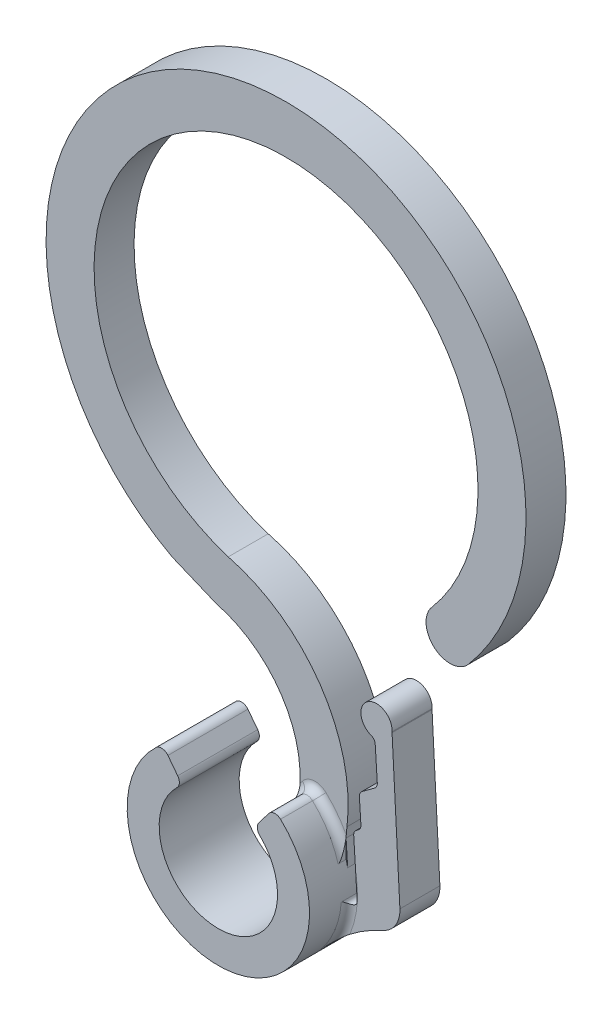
ISO-10303-21;
HEADER;
FILE_DESCRIPTION(('STEP AP214'),'2;1');
FILE_NAME('part.step','',(''),(''),'','','');
FILE_SCHEMA(('AUTOMOTIVE_DESIGN { 1 0 10303 214 1 1 1 1 }'));
ENDSEC;
DATA;
#1=APPLICATION_CONTEXT('core data for automotive mechanical design processes');
#2=APPLICATION_PROTOCOL_DEFINITION('international standard','automotive_design',2000,#1);
#3=PRODUCT_CONTEXT('',#1,'mechanical');
#4=PRODUCT('Part','Part','',(#3));
#5=PRODUCT_RELATED_PRODUCT_CATEGORY('part','',(#4));
#6=PRODUCT_DEFINITION_FORMATION('','',#4);
#7=PRODUCT_DEFINITION_CONTEXT('part definition',#1,'design');
#8=PRODUCT_DEFINITION('design','',#6,#7);
#9=PRODUCT_DEFINITION_SHAPE('','',#8);
#10=(LENGTH_UNIT() NAMED_UNIT(*) SI_UNIT(.MILLI.,.METRE.));
#11=(NAMED_UNIT(*) PLANE_ANGLE_UNIT() SI_UNIT($,.RADIAN.));
#12=(NAMED_UNIT(*) SI_UNIT($,.STERADIAN.) SOLID_ANGLE_UNIT());
#13=UNCERTAINTY_MEASURE_WITH_UNIT(LENGTH_MEASURE(1.E-05),#10,'distance_accuracy_value','');
#14=(GEOMETRIC_REPRESENTATION_CONTEXT(3) GLOBAL_UNCERTAINTY_ASSIGNED_CONTEXT((#13)) GLOBAL_UNIT_ASSIGNED_CONTEXT((#10,
#11,#12)) REPRESENTATION_CONTEXT('',''));
#15=CARTESIAN_POINT('',(0.,0.,0.));
#16=DIRECTION('',(0.,0.,1.));
#17=DIRECTION('',(1.,0.,0.));
#18=AXIS2_PLACEMENT_3D('',#15,#16,#17);
#19=CARTESIAN_POINT('',(0.,0.,5.));
#20=DIRECTION('',(0.,0.,-1.));
#21=DIRECTION('',(-1.,0.,0.));
#22=AXIS2_PLACEMENT_3D('',#19,#20,#21);
#23=CYLINDRICAL_SURFACE('',#22,5.7);
#24=CARTESIAN_POINT('',(0.,0.,3.));
#25=DIRECTION('',(0.,0.,1.));
#26=DIRECTION('',(1.,0.,0.));
#27=AXIS2_PLACEMENT_3D('',#24,#25,#26);
#28=CIRCLE('',#27,5.7);
#29=CARTESIAN_POINT('',(4.36605648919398,-3.66436225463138,3.));
#30=VERTEX_POINT('',#29);
#31=CARTESIAN_POINT('',(5.68465918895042,-0.417911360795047,3.));
#32=VERTEX_POINT('',#31);
#33=EDGE_CURVE('E804',#30,#32,#28,.T.);
#34=ORIENTED_EDGE('',*,*,#33,.T.);
#35=DIRECTION('',(0.,0.,-1.));
#36=VECTOR('',#35,1.);
#37=CARTESIAN_POINT('',(5.68465918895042,-0.417911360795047,17.7682321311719));
#38=LINE('',#37,#36);
#39=CARTESIAN_POINT('',(5.68465918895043,-0.41791136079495,0.));
#40=VERTEX_POINT('',#39);
#41=EDGE_CURVE('E303',#32,#40,#38,.T.);
#42=ORIENTED_EDGE('',*,*,#41,.T.);
#43=CARTESIAN_POINT('',(0.,0.,0.));
#44=DIRECTION('',(0.,0.,1.));
#45=DIRECTION('',(1.,0.,0.));
#46=AXIS2_PLACEMENT_3D('',#43,#44,#45);
#47=CIRCLE('',#46,5.7);
#48=CARTESIAN_POINT('',(5.58500552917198,1.13917217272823,0.));
#49=VERTEX_POINT('',#48);
#50=EDGE_CURVE('E321',#40,#49,#47,.T.);
#51=ORIENTED_EDGE('',*,*,#50,.T.);
#52=DIRECTION('',(0.,0.,-1.));
#53=VECTOR('',#52,1.);
#54=CARTESIAN_POINT('',(5.58500552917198,1.13917217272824,5.));
#55=LINE('',#54,#53);
#56=CARTESIAN_POINT('',(5.58500552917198,1.13917217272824,2.5));
#57=VERTEX_POINT('',#56);
#58=EDGE_CURVE('E361',#49,#57,#55,.F.);
#59=ORIENTED_EDGE('',*,*,#58,.T.);
#60=CARTESIAN_POINT('',(0.,0.,2.5));
#61=DIRECTION('',(0.,0.,1.));
#62=DIRECTION('',(1.,0.,0.));
#63=AXIS2_PLACEMENT_3D('',#60,#61,#62);
#64=CIRCLE('',#63,5.7);
#65=CARTESIAN_POINT('',(5.48661017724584,1.54502710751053,2.5));
#66=VERTEX_POINT('',#65);
#67=EDGE_CURVE('E409',#57,#66,#64,.T.);
#68=ORIENTED_EDGE('',*,*,#67,.T.);
#69=DIRECTION('',(0.,0.,-1.));
#70=VECTOR('',#69,1.);
#71=CARTESIAN_POINT('',(5.48661017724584,1.54502710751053,1.25));
#72=LINE('',#71,#70);
#73=CARTESIAN_POINT('',(5.48661017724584,1.54502710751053,3.));
#74=VERTEX_POINT('',#73);
#75=EDGE_CURVE('E563',#74,#66,#72,.T.);
#76=ORIENTED_EDGE('',*,*,#75,.F.);
#77=CARTESIAN_POINT('',(0.,0.,3.));
#78=DIRECTION('',(0.,0.,1.));
#79=DIRECTION('',(1.,0.,0.));
#80=AXIS2_PLACEMENT_3D('',#77,#78,#79);
#81=CIRCLE('',#80,5.7);
#82=CARTESIAN_POINT('',(3.88695157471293,4.16912550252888,3.));
#83=VERTEX_POINT('',#82);
#84=EDGE_CURVE('E586',#74,#83,#81,.T.);
#85=ORIENTED_EDGE('',*,*,#84,.T.);
#86=DIRECTION('',(0.,0.,-1.));
#87=VECTOR('',#86,1.);
#88=CARTESIAN_POINT('',(3.88695157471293,4.16912550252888,5.));
#89=LINE('',#88,#87);
#90=CARTESIAN_POINT('',(3.88695157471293,4.16912550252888,5.));
#91=VERTEX_POINT('',#90);
#92=EDGE_CURVE('E547',#83,#91,#89,.F.);
#93=ORIENTED_EDGE('',*,*,#92,.T.);
#94=CARTESIAN_POINT('',(0.,0.,5.));
#95=DIRECTION('',(0.,0.,1.));
#96=DIRECTION('',(1.,0.,0.));
#97=AXIS2_PLACEMENT_3D('',#94,#95,#96);
#98=CIRCLE('',#97,5.7);
#99=CARTESIAN_POINT('',(-3.89040931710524,4.16589910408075,5.));
#100=VERTEX_POINT('',#99);
#101=EDGE_CURVE('E504',#100,#91,#98,.T.);
#102=ORIENTED_EDGE('',*,*,#101,.F.);
#103=DIRECTION('',(0.,0.,-1.));
#104=VECTOR('',#103,1.);
#105=CARTESIAN_POINT('',(-3.89040931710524,4.16589910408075,5.));
#106=LINE('',#105,#104);
#107=CARTESIAN_POINT('',(-3.89040931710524,4.16589910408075,0.));
#108=VERTEX_POINT('',#107);
#109=EDGE_CURVE('E550',#100,#108,#106,.T.);
#110=ORIENTED_EDGE('',*,*,#109,.T.);
#111=CARTESIAN_POINT('',(4.36605648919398,-3.66436225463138,0.));
#112=VERTEX_POINT('',#111);
#113=EDGE_CURVE('E509',#108,#112,#47,.T.);
#114=ORIENTED_EDGE('',*,*,#113,.T.);
#115=DIRECTION('',(0.,0.,-1.));
#116=VECTOR('',#115,1.);
#117=CARTESIAN_POINT('',(4.36605648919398,-3.66436225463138,17.7682321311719));
#118=LINE('',#117,#116);
#119=EDGE_CURVE('E362',#30,#112,#118,.T.);
#120=ORIENTED_EDGE('',*,*,#119,.F.);
#121=EDGE_LOOP('',(#34,#42,#51,#59,#68,#76,#85,#93,#102,#110,#114,#120));
#122=FACE_BOUND('',#121,.T.);
#123=ADVANCED_FACE('F43',(#122),#23,.T.);
#124=CARTESIAN_POINT('',(0.,0.,5.));
#125=DIRECTION('',(0.,0.,1.));
#126=DIRECTION('',(1.,0.,0.));
#127=AXIS2_PLACEMENT_3D('',#124,#125,#126);
#128=PLANE('',#127);
#129=CARTESIAN_POINT('',(0.,0.,5.));
#130=DIRECTION('',(0.,0.,1.));
#131=DIRECTION('',(1.,0.,0.));
#132=AXIS2_PLACEMENT_3D('',#129,#130,#131);
#133=CIRCLE('',#132,3.7);
#134=CARTESIAN_POINT('',(-2.5869501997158,2.64531447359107,5.));
#135=VERTEX_POINT('',#134);
#136=CARTESIAN_POINT('',(2.58475451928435,2.64745992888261,5.));
#137=VERTEX_POINT('',#136);
#138=EDGE_CURVE('E497',#135,#137,#133,.T.);
#139=ORIENTED_EDGE('',*,*,#138,.F.);
#140=CARTESIAN_POINT('',(-2.93653806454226,3.00278940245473,5.));
#141=DIRECTION('',(0.,0.,1.));
#142=DIRECTION('',(1.,0.,0.));
#143=AXIS2_PLACEMENT_3D('',#140,#141,#142);
#144=CIRCLE('',#143,0.5);
#145=CARTESIAN_POINT('',(-2.53998769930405,3.30733465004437,5.));
#146=VERTEX_POINT('',#145);
#147=EDGE_CURVE('E528',#135,#146,#144,.T.);
#148=ORIENTED_EDGE('',*,*,#147,.T.);
#149=DIRECTION('',(-0.609090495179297,0.793100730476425,0.));
#150=VECTOR('',#149,1.);
#151=CARTESIAN_POINT('',(0.,0.,5.));
#152=LINE('',#151,#150);
#153=CARTESIAN_POINT('',(-3.15259497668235,4.1050146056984,5.));
#154=VERTEX_POINT('',#153);
#155=EDGE_CURVE('E488',#146,#154,#152,.T.);
#156=ORIENTED_EDGE('',*,*,#155,.T.);
#157=CARTESIAN_POINT('',(-3.54914534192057,3.80046935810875,5.));
#158=DIRECTION('',(0.,0.,1.));
#159=DIRECTION('',(1.,0.,0.));
#160=AXIS2_PLACEMENT_3D('',#157,#158,#159);
#161=CIRCLE('',#160,0.5);
#162=EDGE_CURVE('E525',#154,#100,#161,.T.);
#163=ORIENTED_EDGE('',*,*,#162,.T.);
#164=ORIENTED_EDGE('',*,*,#101,.T.);
#165=CARTESIAN_POINT('',(3.54599091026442,3.80341273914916,5.));
#166=DIRECTION('',(0.,0.,1.));
#167=DIRECTION('',(1.,0.,0.));
#168=AXIS2_PLACEMENT_3D('',#165,#166,#167);
#169=CIRCLE('',#168,0.5);
#170=CARTESIAN_POINT('',(3.14918800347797,4.10762886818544,5.));
#171=VERTEX_POINT('',#170);
#172=EDGE_CURVE('E522',#91,#171,#169,.T.);
#173=ORIENTED_EDGE('',*,*,#172,.T.);
#174=DIRECTION('',(-0.608432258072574,-0.793605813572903,0.));
#175=VECTOR('',#174,1.);
#176=CARTESIAN_POINT('',(0.,0.,5.));
#177=LINE('',#176,#175);
#178=CARTESIAN_POINT('',(2.53724276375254,3.30944091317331,5.));
#179=VERTEX_POINT('',#178);
#180=EDGE_CURVE('E484',#171,#179,#177,.T.);
#181=ORIENTED_EDGE('',*,*,#180,.T.);
#182=CARTESIAN_POINT('',(2.93404567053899,3.00522478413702,5.));
#183=DIRECTION('',(0.,0.,1.));
#184=DIRECTION('',(1.,0.,0.));
#185=AXIS2_PLACEMENT_3D('',#182,#183,#184);
#186=CIRCLE('',#185,0.5);
#187=EDGE_CURVE('E519',#179,#137,#186,.T.);
#188=ORIENTED_EDGE('',*,*,#187,.T.);
#189=EDGE_LOOP('',(#139,#148,#156,#163,#164,#173,#181,#188));
#190=FACE_BOUND('',#189,.T.);
#191=ADVANCED_FACE('F740',(#190),#128,.T.);
#192=CARTESIAN_POINT('',(0.,0.,0.));
#193=DIRECTION('',(0.,0.,1.));
#194=DIRECTION('',(1.,0.,0.));
#195=AXIS2_PLACEMENT_3D('',#192,#193,#194);
#196=PLANE('',#195);
#197=DIRECTION('',(-0.0638695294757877,0.997958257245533,0.));
#198=VECTOR('',#197,1.);
#199=CARTESIAN_POINT('',(6.63279061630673,0.424499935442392,0.));
#200=LINE('',#199,#198);
#201=CARTESIAN_POINT('',(6.41199066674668,3.87448828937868,0.));
#202=VERTEX_POINT('',#201);
#203=CARTESIAN_POINT('',(6.31667480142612,5.36379399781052,0.));
#204=VERTEX_POINT('',#203);
#205=EDGE_CURVE('E332',#202,#204,#200,.T.);
#206=ORIENTED_EDGE('',*,*,#205,.T.);
#207=CARTESIAN_POINT('',(6.71585810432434,5.38934180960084,0.));
#208=DIRECTION('',(0.,0.,1.));
#209=DIRECTION('',(1.,0.,0.));
#210=AXIS2_PLACEMENT_3D('',#207,#208,#209);
#211=CIRCLE('',#210,0.4);
#212=CARTESIAN_POINT('',(6.47687782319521,5.71010406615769,0.));
#213=VERTEX_POINT('',#212);
#214=EDGE_CURVE('E816',#204,#213,#211,.F.);
#215=ORIENTED_EDGE('',*,*,#214,.T.);
#216=DIRECTION('',(0.801905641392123,0.597450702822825,0.));
#217=VECTOR('',#216,1.);
#218=CARTESIAN_POINT('',(-0.423801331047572,0.568831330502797,0.));
#219=LINE('',#218,#217);
#220=CARTESIAN_POINT('',(7.27647229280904,6.30583285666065,0.));
#221=VERTEX_POINT('',#220);
#222=EDGE_CURVE('E335',#213,#221,#219,.T.);
#223=ORIENTED_EDGE('',*,*,#222,.T.);
#224=CARTESIAN_POINT('',(7.03749201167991,6.6265951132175,0.));
#225=DIRECTION('',(0.,0.,1.));
#226=DIRECTION('',(1.,0.,0.));
#227=AXIS2_PLACEMENT_3D('',#224,#225,#226);
#228=CIRCLE('',#227,0.4);
#229=CARTESIAN_POINT('',(7.43667531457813,6.65214292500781,0.));
#230=VERTEX_POINT('',#229);
#231=EDGE_CURVE('E845',#221,#230,#228,.T.);
#232=ORIENTED_EDGE('',*,*,#231,.T.);
#233=DIRECTION('',(-0.0638695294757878,0.997958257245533,0.));
#234=VECTOR('',#233,1.);
#235=CARTESIAN_POINT('',(7.83034052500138,0.501143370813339,0.));
#236=LINE('',#235,#234);
#237=CARTESIAN_POINT('',(7.30614663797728,8.69164707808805,0.));
#238=VERTEX_POINT('',#237);
#239=EDGE_CURVE('E339',#230,#238,#236,.T.);
#240=ORIENTED_EDGE('',*,*,#239,.T.);
#241=CARTESIAN_POINT('',(6.90696333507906,8.66609926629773,0.));
#242=DIRECTION('',(0.,0.,1.));
#243=DIRECTION('',(1.,0.,0.));
#244=AXIS2_PLACEMENT_3D('',#241,#242,#243);
#245=CIRCLE('',#244,0.4);
#246=CARTESIAN_POINT('',(7.04627138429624,9.04105695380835,0.));
#247=VERTEX_POINT('',#246);
#248=EDGE_CURVE('E839',#238,#247,#245,.T.);
#249=ORIENTED_EDGE('',*,*,#248,.T.);
#250=CARTESIAN_POINT('',(7.38590102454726,9.95519468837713,0.));
#251=DIRECTION('',(0.,0.,1.));
#252=DIRECTION('',(1.,0.,0.));
#253=AXIS2_PLACEMENT_3D('',#250,#251,#252);
#254=CIRCLE('',#253,0.975190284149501);
#255=CARTESIAN_POINT('',(8.358870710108,9.88942173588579,0.));
#256=VERTEX_POINT('',#255);
#257=EDGE_CURVE('E344',#256,#247,#254,.T.);
#258=ORIENTED_EDGE('',*,*,#257,.F.);
#259=CARTESIAN_POINT('',(8.75795987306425,9.86244322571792,0.));
#260=DIRECTION('',(0.,0.,1.));
#261=DIRECTION('',(1.,0.,0.));
#262=AXIS2_PLACEMENT_3D('',#259,#260,#261);
#263=CIRCLE('',#262,0.4);
#264=CARTESIAN_POINT('',(8.35851692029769,9.84134044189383,0.));
#265=VERTEX_POINT('',#264);
#266=EDGE_CURVE('E833',#256,#265,#263,.T.);
#267=ORIENTED_EDGE('',*,*,#266,.T.);
#268=DIRECTION('',(0.0527569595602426,-0.998607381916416,0.));
#269=VECTOR('',#268,1.);
#270=CARTESIAN_POINT('',(8.85372884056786,0.467747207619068,0.));
#271=LINE('',#270,#269);
#272=CARTESIAN_POINT('',(8.84949848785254,0.547821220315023,0.));
#273=VERTEX_POINT('',#272);
#274=EDGE_CURVE('E343',#265,#273,#271,.T.);
#275=ORIENTED_EDGE('',*,*,#274,.T.);
#276=CARTESIAN_POINT('',(7.06393197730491,0.481585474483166,0.));
#277=DIRECTION('',(0.,0.,1.));
#278=DIRECTION('',(1.,0.,0.));
#279=AXIS2_PLACEMENT_3D('',#276,#277,#278);
#280=CIRCLE('',#279,1.78679459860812);
#281=CARTESIAN_POINT('',(7.79104407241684,-1.15057350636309,0.));
#282=VERTEX_POINT('',#281);
#283=EDGE_CURVE('E352',#273,#282,#280,.F.);
#284=ORIENTED_EDGE('',*,*,#283,.T.);
#285=CARTESIAN_POINT('',(11.8604099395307,-10.2851376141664,0.));
#286=DIRECTION('',(0.,0.,1.));
#287=DIRECTION('',(1.,0.,0.));
#288=AXIS2_PLACEMENT_3D('',#285,#286,#287);
#289=CIRCLE('',#288,10.);
#290=EDGE_CURVE('E357',#112,#282,#289,.F.);
#291=ORIENTED_EDGE('',*,*,#290,.F.);
#292=ORIENTED_EDGE('',*,*,#113,.F.);
#293=CARTESIAN_POINT('',(-3.54914534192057,3.80046935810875,0.));
#294=DIRECTION('',(0.,0.,1.));
#295=DIRECTION('',(1.,0.,0.));
#296=AXIS2_PLACEMENT_3D('',#293,#294,#295);
#297=CIRCLE('',#296,0.5);
#298=CARTESIAN_POINT('',(-3.15259497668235,4.1050146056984,0.));
#299=VERTEX_POINT('',#298);
#300=EDGE_CURVE('E541',#108,#299,#297,.F.);
#301=ORIENTED_EDGE('',*,*,#300,.T.);
#302=DIRECTION('',(-0.609090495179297,0.793100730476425,0.));
#303=VECTOR('',#302,1.);
#304=CARTESIAN_POINT('',(0.,0.,0.));
#305=LINE('',#304,#303);
#306=CARTESIAN_POINT('',(-2.53998769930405,3.30733465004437,0.));
#307=VERTEX_POINT('',#306);
#308=EDGE_CURVE('E492',#307,#299,#305,.T.);
#309=ORIENTED_EDGE('',*,*,#308,.F.);
#310=CARTESIAN_POINT('',(-2.93653806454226,3.00278940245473,0.));
#311=DIRECTION('',(0.,0.,1.));
#312=DIRECTION('',(1.,0.,0.));
#313=AXIS2_PLACEMENT_3D('',#310,#311,#312);
#314=CIRCLE('',#313,0.5);
#315=CARTESIAN_POINT('',(-2.5869501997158,2.64531447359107,0.));
#316=VERTEX_POINT('',#315);
#317=EDGE_CURVE('E544',#307,#316,#314,.F.);
#318=ORIENTED_EDGE('',*,*,#317,.T.);
#319=CARTESIAN_POINT('',(0.,0.,0.));
#320=DIRECTION('',(0.,0.,1.));
#321=DIRECTION('',(1.,0.,0.));
#322=AXIS2_PLACEMENT_3D('',#319,#320,#321);
#323=CIRCLE('',#322,3.7);
#324=CARTESIAN_POINT('',(2.58475451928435,2.64745992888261,0.));
#325=VERTEX_POINT('',#324);
#326=EDGE_CURVE('E496',#316,#325,#323,.T.);
#327=ORIENTED_EDGE('',*,*,#326,.T.);
#328=CARTESIAN_POINT('',(2.93404567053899,3.00522478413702,0.));
#329=DIRECTION('',(0.,0.,1.));
#330=DIRECTION('',(1.,0.,0.));
#331=AXIS2_PLACEMENT_3D('',#328,#329,#330);
#332=CIRCLE('',#331,0.5);
#333=CARTESIAN_POINT('',(2.49182029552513,3.23854155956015,0.));
#334=VERTEX_POINT('',#333);
#335=EDGE_CURVE('E538',#325,#334,#332,.F.);
#336=ORIENTED_EDGE('',*,*,#335,.T.);
#337=CARTESIAN_POINT('',(-4.40111221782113,4.54502231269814,0.));
#338=DIRECTION('',(0.,0.,1.));
#339=DIRECTION('',(1.,0.,0.));
#340=AXIS2_PLACEMENT_3D('',#337,#338,#339);
#341=CIRCLE('',#340,7.01565468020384);
#342=CARTESIAN_POINT('',(-2.63576617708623,11.3349386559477,0.));
#343=VERTEX_POINT('',#342);
#344=EDGE_CURVE('E448',#334,#343,#341,.T.);
#345=ORIENTED_EDGE('',*,*,#344,.T.);
#346=DIRECTION('',(0.92314428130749,-0.384453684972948,0.));
#347=VECTOR('',#346,1.);
#348=CARTESIAN_POINT('',(3.63326178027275,8.72413236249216,0.));
#349=LINE('',#348,#347);
#350=CARTESIAN_POINT('',(-5.40519902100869,12.4882997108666,0.));
#351=VERTEX_POINT('',#350);
#352=EDGE_CURVE('E443',#351,#343,#349,.T.);
#353=ORIENTED_EDGE('',*,*,#352,.F.);
#354=CARTESIAN_POINT('',(1.73143335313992,25.6818010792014,0.));
#355=DIRECTION('',(0.,0.,1.));
#356=DIRECTION('',(1.,0.,0.));
#357=AXIS2_PLACEMENT_3D('',#354,#355,#356);
#358=CIRCLE('',#357,15.);
#359=CARTESIAN_POINT('',(13.1228539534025,15.9229314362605,0.));
#360=VERTEX_POINT('',#359);
#361=EDGE_CURVE('E439',#351,#360,#358,.F.);
#362=ORIENTED_EDGE('',*,*,#361,.T.);
#363=CARTESIAN_POINT('',(11.9837118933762,16.8988184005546,0.));
#364=DIRECTION('',(0.,0.,1.));
#365=DIRECTION('',(1.,0.,0.));
#366=AXIS2_PLACEMENT_3D('',#363,#364,#365);
#367=CIRCLE('',#366,1.5);
#368=CARTESIAN_POINT('',(10.84456983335,17.8747053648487,0.));
#369=VERTEX_POINT('',#368);
#370=EDGE_CURVE('E419',#369,#360,#367,.T.);
#371=ORIENTED_EDGE('',*,*,#370,.F.);
#372=CARTESIAN_POINT('',(1.73143335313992,25.6818010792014,0.));
#373=DIRECTION('',(0.,0.,1.));
#374=DIRECTION('',(1.,0.,0.));
#375=AXIS2_PLACEMENT_3D('',#372,#373,#374);
#376=CIRCLE('',#375,12.);
#377=CARTESIAN_POINT('',(-1.88087752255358,14.2384095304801,0.));
#378=VERTEX_POINT('',#377);
#379=EDGE_CURVE('E457',#378,#369,#376,.F.);
#380=ORIENTED_EDGE('',*,*,#379,.F.);
#381=CARTESIAN_POINT('',(-4.40111221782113,4.54502231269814,0.));
#382=DIRECTION('',(0.,0.,1.));
#383=DIRECTION('',(1.,0.,0.));
#384=AXIS2_PLACEMENT_3D('',#381,#382,#383);
#385=CIRCLE('',#384,10.0156546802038);
#386=CARTESIAN_POINT('',(5.54176580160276,3.3398188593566,0.));
#387=VERTEX_POINT('',#386);
#388=EDGE_CURVE('E454',#387,#378,#385,.T.);
#389=ORIENTED_EDGE('',*,*,#388,.F.);
#390=CARTESIAN_POINT('',(15.4691028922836,2.13649916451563,0.));
#391=DIRECTION('',(0.,0.,1.));
#392=DIRECTION('',(1.,0.,0.));
#393=AXIS2_PLACEMENT_3D('',#390,#391,#392);
#394=CIRCLE('',#393,10.);
#395=CARTESIAN_POINT('',(5.48504846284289,2.70099641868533,0.));
#396=VERTEX_POINT('',#395);
#397=EDGE_CURVE('E451',#396,#387,#394,.F.);
#398=ORIENTED_EDGE('',*,*,#397,.F.);
#399=DIRECTION('',(0.0638695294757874,-0.997958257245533,0.));
#400=VECTOR('',#399,1.);
#401=CARTESIAN_POINT('',(5.6348323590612,0.360630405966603,0.));
#402=LINE('',#401,#400);
#403=EDGE_CURVE('E323',#396,#49,#402,.T.);
#404=ORIENTED_EDGE('',*,*,#403,.T.);
#405=ORIENTED_EDGE('',*,*,#50,.F.);
#406=CARTESIAN_POINT('',(5.93414876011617,-0.401944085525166,0.));
#407=DIRECTION('',(0.,0.,1.));
#408=DIRECTION('',(1.,0.,0.));
#409=AXIS2_PLACEMENT_3D('',#406,#407,#408);
#410=CIRCLE('',#409,0.250000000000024);
#411=CARTESIAN_POINT('',(6.18363833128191,-0.385976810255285,0.));
#412=VERTEX_POINT('',#411);
#413=EDGE_CURVE('E296',#40,#412,#410,.T.);
#414=ORIENTED_EDGE('',*,*,#413,.T.);
#415=DIRECTION('',(-0.0638695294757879,0.997958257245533,0.));
#416=VECTOR('',#415,1.);
#417=CARTESIAN_POINT('',(6.13381148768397,0.392565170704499,0.));
#418=LINE('',#417,#416);
#419=CARTESIAN_POINT('',(5.96149838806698,3.08494887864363,0.));
#420=VERTEX_POINT('',#419);
#421=EDGE_CURVE('E307',#412,#420,#418,.T.);
#422=ORIENTED_EDGE('',*,*,#421,.T.);
#423=CARTESIAN_POINT('',(6.36068169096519,3.11049669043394,0.));
#424=DIRECTION('',(0.,0.,1.));
#425=DIRECTION('',(1.,0.,0.));
#426=AXIS2_PLACEMENT_3D('',#423,#424,#425);
#427=CIRCLE('',#426,0.4);
#428=CARTESIAN_POINT('',(6.12170140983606,3.43125894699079,0.));
#429=VERTEX_POINT('',#428);
#430=EDGE_CURVE('E821',#420,#429,#427,.F.);
#431=ORIENTED_EDGE('',*,*,#430,.T.);
#432=DIRECTION('',(0.801905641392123,0.597450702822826,0.));
#433=VECTOR('',#432,1.);
#434=CARTESIAN_POINT('',(0.541212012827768,-0.72642138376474,0.));
#435=LINE('',#434,#433);
#436=CARTESIAN_POINT('',(6.25178764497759,3.52817822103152,0.));
#437=VERTEX_POINT('',#436);
#438=EDGE_CURVE('E314',#429,#437,#435,.T.);
#439=ORIENTED_EDGE('',*,*,#438,.T.);
#440=CARTESIAN_POINT('',(6.01280736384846,3.84894047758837,0.));
#441=DIRECTION('',(0.,0.,1.));
#442=DIRECTION('',(1.,0.,0.));
#443=AXIS2_PLACEMENT_3D('',#440,#441,#442);
#444=CIRCLE('',#443,0.4);
#445=EDGE_CURVE('E52',#437,#202,#444,.T.);
#446=ORIENTED_EDGE('',*,*,#445,.T.);
#447=EDGE_LOOP('',(#206,#215,#223,#232,#240,#249,#258,#267,#275,#284,#291,#292,#301,#309,#318,
#327,#336,#345,#353,#362,#371,#380,#389,#398,#404,#405,#414,#422,#431,#439,#446));
#448=FACE_BOUND('',#447,.T.);
#449=ADVANCED_FACE('F318',(#448),#196,.F.);
#450=CARTESIAN_POINT('',(0.,0.,5.));
#451=DIRECTION('',(0.,0.,-1.));
#452=DIRECTION('',(-1.,0.,0.));
#453=AXIS2_PLACEMENT_3D('',#450,#451,#452);
#454=CYLINDRICAL_SURFACE('',#453,3.7);
#455=ORIENTED_EDGE('',*,*,#326,.F.);
#456=DIRECTION('',(0.,0.,-1.));
#457=VECTOR('',#456,1.);
#458=CARTESIAN_POINT('',(-2.5869501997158,2.64531447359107,5.));
#459=LINE('',#458,#457);
#460=EDGE_CURVE('E515',#316,#135,#459,.F.);
#461=ORIENTED_EDGE('',*,*,#460,.T.);
#462=ORIENTED_EDGE('',*,*,#138,.T.);
#463=DIRECTION('',(0.,0.,-1.));
#464=VECTOR('',#463,1.);
#465=CARTESIAN_POINT('',(2.58475451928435,2.64745992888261,5.));
#466=LINE('',#465,#464);
#467=EDGE_CURVE('E508',#137,#325,#466,.T.);
#468=ORIENTED_EDGE('',*,*,#467,.T.);
#469=EDGE_LOOP('',(#455,#461,#462,#468));
#470=FACE_BOUND('',#469,.T.);
#471=ADVANCED_FACE('F946',(#470),#454,.F.);
#472=CARTESIAN_POINT('',(0.,0.,-1.2E-05));
#473=DIRECTION('',(0.793100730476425,0.609090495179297,0.));
#474=DIRECTION('',(-0.609090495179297,0.793100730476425,0.));
#475=AXIS2_PLACEMENT_3D('',#472,#473,#474);
#476=PLANE('',#475);
#477=ORIENTED_EDGE('',*,*,#155,.F.);
#478=DIRECTION('',(0.,0.,-1.));
#479=VECTOR('',#478,1.);
#480=CARTESIAN_POINT('',(-2.53998769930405,3.30733465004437,-1.2E-05));
#481=LINE('',#480,#479);
#482=EDGE_CURVE('E535',#146,#307,#481,.T.);
#483=ORIENTED_EDGE('',*,*,#482,.T.);
#484=ORIENTED_EDGE('',*,*,#308,.T.);
#485=DIRECTION('',(0.,0.,1.));
#486=VECTOR('',#485,1.);
#487=CARTESIAN_POINT('',(-3.15259497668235,4.1050146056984,5.));
#488=LINE('',#487,#486);
#489=EDGE_CURVE('E531',#299,#154,#488,.T.);
#490=ORIENTED_EDGE('',*,*,#489,.T.);
#491=EDGE_LOOP('',(#477,#483,#484,#490));
#492=FACE_BOUND('',#491,.T.);
#493=ADVANCED_FACE('F941',(#492),#476,.T.);
#494=CARTESIAN_POINT('',(0.,0.,-1.2E-05));
#495=DIRECTION('',(-0.793605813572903,0.608432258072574,0.));
#496=DIRECTION('',(-0.608432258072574,-0.793605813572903,0.));
#497=AXIS2_PLACEMENT_3D('',#494,#495,#496);
#498=PLANE('',#497);
#499=DIRECTION('',(0.,0.,1.));
#500=VECTOR('',#499,1.);
#501=CARTESIAN_POINT('',(3.14918800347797,4.10762886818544,0.));
#502=LINE('',#501,#500);
#503=CARTESIAN_POINT('',(3.14918800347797,4.10762886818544,3.));
#504=VERTEX_POINT('',#503);
#505=EDGE_CURVE('E556',#171,#504,#502,.F.);
#506=ORIENTED_EDGE('',*,*,#505,.T.);
#507=DIRECTION('',(0.608432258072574,0.793605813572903,0.));
#508=VECTOR('',#507,1.);
#509=CARTESIAN_POINT('',(2.53724276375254,3.30944091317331,3.));
#510=LINE('',#509,#508);
#511=CARTESIAN_POINT('',(2.53724276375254,3.30944091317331,3.));
#512=VERTEX_POINT('',#511);
#513=EDGE_CURVE('E580',#504,#512,#510,.F.);
#514=ORIENTED_EDGE('',*,*,#513,.T.);
#515=DIRECTION('',(0.,0.,-1.));
#516=VECTOR('',#515,1.);
#517=CARTESIAN_POINT('',(2.53724276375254,3.30944091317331,-1.2E-05));
#518=LINE('',#517,#516);
#519=EDGE_CURVE('E553',#512,#179,#518,.F.);
#520=ORIENTED_EDGE('',*,*,#519,.T.);
#521=ORIENTED_EDGE('',*,*,#180,.F.);
#522=EDGE_LOOP('',(#506,#514,#520,#521));
#523=FACE_BOUND('',#522,.T.);
#524=ADVANCED_FACE('F755',(#523),#498,.T.);
#525=CARTESIAN_POINT('',(-2.93653806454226,3.00278940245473,5.));
#526=DIRECTION('',(0.,0.,-1.));
#527=DIRECTION('',(-1.,0.,0.));
#528=AXIS2_PLACEMENT_3D('',#525,#526,#527);
#529=CYLINDRICAL_SURFACE('',#528,0.5);
#530=ORIENTED_EDGE('',*,*,#317,.F.);
#531=ORIENTED_EDGE('',*,*,#482,.F.);
#532=ORIENTED_EDGE('',*,*,#147,.F.);
#533=ORIENTED_EDGE('',*,*,#460,.F.);
#534=EDGE_LOOP('',(#530,#531,#532,#533));
#535=FACE_BOUND('',#534,.T.);
#536=ADVANCED_FACE('F751',(#535),#529,.T.);
#537=CARTESIAN_POINT('',(-3.54914534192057,3.80046935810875,5.));
#538=DIRECTION('',(0.,0.,-1.));
#539=DIRECTION('',(-1.,0.,0.));
#540=AXIS2_PLACEMENT_3D('',#537,#538,#539);
#541=CYLINDRICAL_SURFACE('',#540,0.5);
#542=ORIENTED_EDGE('',*,*,#300,.F.);
#543=ORIENTED_EDGE('',*,*,#109,.F.);
#544=ORIENTED_EDGE('',*,*,#162,.F.);
#545=ORIENTED_EDGE('',*,*,#489,.F.);
#546=EDGE_LOOP('',(#542,#543,#544,#545));
#547=FACE_BOUND('',#546,.T.);
#548=ADVANCED_FACE('F754',(#547),#541,.T.);
#549=CARTESIAN_POINT('',(3.54599091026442,3.80341273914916,5.));
#550=DIRECTION('',(0.,0.,-1.));
#551=DIRECTION('',(-1.,0.,0.));
#552=AXIS2_PLACEMENT_3D('',#549,#550,#551);
#553=CYLINDRICAL_SURFACE('',#552,0.5);
#554=ORIENTED_EDGE('',*,*,#92,.F.);
#555=CARTESIAN_POINT('',(3.54599091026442,3.80341273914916,3.));
#556=DIRECTION('',(0.,0.,1.));
#557=DIRECTION('',(1.,0.,0.));
#558=AXIS2_PLACEMENT_3D('',#555,#556,#557);
#559=CIRCLE('',#558,0.5);
#560=EDGE_CURVE('E583',#83,#504,#559,.T.);
#561=ORIENTED_EDGE('',*,*,#560,.T.);
#562=ORIENTED_EDGE('',*,*,#505,.F.);
#563=ORIENTED_EDGE('',*,*,#172,.F.);
#564=EDGE_LOOP('',(#554,#561,#562,#563));
#565=FACE_BOUND('',#564,.T.);
#566=ADVANCED_FACE('F758',(#565),#553,.T.);
#567=CARTESIAN_POINT('',(2.93404567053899,3.00522478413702,5.));
#568=DIRECTION('',(0.,0.,-1.));
#569=DIRECTION('',(-1.,0.,0.));
#570=AXIS2_PLACEMENT_3D('',#567,#568,#569);
#571=CYLINDRICAL_SURFACE('',#570,0.5);
#572=ORIENTED_EDGE('',*,*,#519,.F.);
#573=CARTESIAN_POINT('',(2.93404567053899,3.00522478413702,3.));
#574=DIRECTION('',(0.,0.,1.));
#575=DIRECTION('',(1.,0.,0.));
#576=AXIS2_PLACEMENT_3D('',#573,#574,#575);
#577=CIRCLE('',#576,0.5);
#578=CARTESIAN_POINT('',(2.49182029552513,3.23854155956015,3.));
#579=VERTEX_POINT('',#578);
#580=EDGE_CURVE('E567',#512,#579,#577,.T.);
#581=ORIENTED_EDGE('',*,*,#580,.T.);
#582=DIRECTION('',(0.,0.,-1.));
#583=VECTOR('',#582,1.);
#584=CARTESIAN_POINT('',(2.49182029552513,3.23854155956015,1.25));
#585=LINE('',#584,#583);
#586=EDGE_CURVE('E560',#334,#579,#585,.F.);
#587=ORIENTED_EDGE('',*,*,#586,.F.);
#588=ORIENTED_EDGE('',*,*,#335,.F.);
#589=ORIENTED_EDGE('',*,*,#467,.F.);
#590=ORIENTED_EDGE('',*,*,#187,.F.);
#591=EDGE_LOOP('',(#572,#581,#587,#588,#589,#590));
#592=FACE_BOUND('',#591,.T.);
#593=ADVANCED_FACE('F616',(#592),#571,.T.);
#594=CARTESIAN_POINT('',(15.4691028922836,2.13649916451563,2.5));
#595=DIRECTION('',(0.,0.,-1.));
#596=DIRECTION('',(-1.,0.,0.));
#597=AXIS2_PLACEMENT_3D('',#594,#595,#596);
#598=CYLINDRICAL_SURFACE('',#597,10.);
#599=ORIENTED_EDGE('',*,*,#75,.T.);
#600=CARTESIAN_POINT('',(15.4691028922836,2.13649916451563,2.5));
#601=DIRECTION('',(0.,0.,1.));
#602=DIRECTION('',(1.,0.,0.));
#603=AXIS2_PLACEMENT_3D('',#600,#601,#602);
#604=CIRCLE('',#603,10.);
#605=CARTESIAN_POINT('',(5.48504846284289,2.70099641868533,2.5));
#606=VERTEX_POINT('',#605);
#607=EDGE_CURVE('E972',#66,#606,#604,.F.);
#608=ORIENTED_EDGE('',*,*,#607,.T.);
#609=DIRECTION('',(0.,0.,-1.));
#610=VECTOR('',#609,1.);
#611=CARTESIAN_POINT('',(5.48504846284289,2.70099641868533,2.5));
#612=LINE('',#611,#610);
#613=EDGE_CURVE('E643',#606,#396,#612,.T.);
#614=ORIENTED_EDGE('',*,*,#613,.T.);
#615=ORIENTED_EDGE('',*,*,#397,.T.);
#616=DIRECTION('',(0.,0.,-1.));
#617=VECTOR('',#616,1.);
#618=CARTESIAN_POINT('',(5.54176580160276,3.3398188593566,2.5));
#619=LINE('',#618,#617);
#620=CARTESIAN_POINT('',(5.54176580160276,3.3398188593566,2.5));
#621=VERTEX_POINT('',#620);
#622=EDGE_CURVE('E473',#621,#387,#619,.T.);
#623=ORIENTED_EDGE('',*,*,#622,.F.);
#624=CARTESIAN_POINT('',(15.4691028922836,2.13649916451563,2.5));
#625=DIRECTION('',(0.,0.,1.));
#626=DIRECTION('',(1.,0.,0.));
#627=AXIS2_PLACEMENT_3D('',#624,#625,#626);
#628=CIRCLE('',#627,10.);
#629=CARTESIAN_POINT('',(5.49600262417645,2.86948691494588,2.5));
#630=VERTEX_POINT('',#629);
#631=EDGE_CURVE('E426',#630,#621,#628,.F.);
#632=ORIENTED_EDGE('',*,*,#631,.F.);
#633=CARTESIAN_POINT('',(5.49600262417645,2.86948691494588,2.5));
#634=CARTESIAN_POINT('',(5.49371153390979,2.8383177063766,2.50000402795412));
#635=CARTESIAN_POINT('',(5.49156788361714,2.80714815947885,2.50081187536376));
#636=CARTESIAN_POINT('',(5.48757736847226,2.74487427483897,2.50389276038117));
#637=CARTESIAN_POINT('',(5.48573038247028,2.71376991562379,2.50616519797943));
#638=CARTESIAN_POINT('',(5.48063833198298,2.6206824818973,2.51496060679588));
#639=CARTESIAN_POINT('',(5.47783719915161,2.5588571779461,2.52346230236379));
#640=CARTESIAN_POINT('',(5.47340241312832,2.43607135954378,2.54491711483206));
#641=CARTESIAN_POINT('',(5.47176688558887,2.37510961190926,2.55786303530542));
#642=CARTESIAN_POINT('',(5.46961211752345,2.25414518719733,2.58773063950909));
#643=CARTESIAN_POINT('',(5.46909288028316,2.19414251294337,2.60465233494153));
#644=CARTESIAN_POINT('',(5.46910943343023,2.09742442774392,2.63537824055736));
#645=CARTESIAN_POINT('',(5.4693251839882,2.06033121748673,2.64800860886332));
#646=CARTESIAN_POINT('',(5.47015650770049,1.98675859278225,2.67490270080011));
#647=CARTESIAN_POINT('',(5.47077189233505,1.95027889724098,2.68916565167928));
#648=CARTESIAN_POINT('',(5.47213287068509,1.88906525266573,2.71498952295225));
#649=CARTESIAN_POINT('',(5.47278249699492,1.86412184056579,2.72605949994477));
#650=CARTESIAN_POINT('',(5.47424937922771,1.81476726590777,2.74931322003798));
#651=CARTESIAN_POINT('',(5.47506657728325,1.79035592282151,2.76149657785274));
#652=CARTESIAN_POINT('',(5.47675398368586,1.74479979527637,2.78598315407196));
#653=CARTESIAN_POINT('',(5.47760998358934,1.72357816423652,2.79814383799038));
#654=CARTESIAN_POINT('',(5.47940982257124,1.68212154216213,2.82407649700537));
#655=CARTESIAN_POINT('',(5.48035360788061,1.66188595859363,2.83784748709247));
#656=CARTESIAN_POINT('',(5.48183510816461,1.63192200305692,2.86118408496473));
#657=CARTESIAN_POINT('',(5.48236637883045,1.62152944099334,2.86988940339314));
#658=CARTESIAN_POINT('',(5.48340984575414,1.60167963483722,2.88833170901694));
#659=CARTESIAN_POINT('',(5.48392205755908,1.59222161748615,2.89806782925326));
#660=CARTESIAN_POINT('',(5.48471490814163,1.57790336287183,2.91531574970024));
#661=CARTESIAN_POINT('',(5.48501453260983,1.57258169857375,2.92243827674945));
#662=CARTESIAN_POINT('',(5.48556156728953,1.56297881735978,2.93736443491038));
#663=CARTESIAN_POINT('',(5.48580906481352,1.55869585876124,2.94516689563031));
#664=CARTESIAN_POINT('',(5.48616731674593,1.55254339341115,2.95938157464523));
#665=CARTESIAN_POINT('',(5.48629682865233,1.55033735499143,2.96564529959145));
#666=CARTESIAN_POINT('',(5.48649285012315,1.54700808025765,2.97844768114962));
#667=CARTESIAN_POINT('',(5.48655955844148,1.54588142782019,2.98498540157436));
#668=CARTESIAN_POINT('',(5.48660368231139,1.54513685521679,2.99437169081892));
#669=CARTESIAN_POINT('',(5.48661036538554,1.54502425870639,2.99718612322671));
#670=CARTESIAN_POINT('',(5.48661017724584,1.54502710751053,3.));
#671=B_SPLINE_CURVE_WITH_KNOTS('',3,(#633,#634,#635,#636,#637,#638,#639,#640,#641,#642,#643,
#644,#645,#646,#647,#648,#649,#650,#651,#652,#653,#654,#655,#656,#657,#658,#659,#660,#661,#662,
#663,#664,#665,#666,#667,#668,#669,#670),.UNSPECIFIED.,.F.,.F.,(4,2,2,2,2,2,2,2,2,2,2,2,2,2,2,2,
2,2,4),(0.,0.093732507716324,0.187426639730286,0.374611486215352,0.561494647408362,
0.748378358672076,0.865902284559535,0.983370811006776,1.06524259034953,1.14708614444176,
1.22047074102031,1.2938106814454,1.33447171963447,1.37509882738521,1.40172929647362,
1.42831479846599,1.44816589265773,1.46795395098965,1.47639566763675),.UNSPECIFIED.);
#672=EDGE_CURVE('E635',#630,#74,#671,.T.);
#673=ORIENTED_EDGE('',*,*,#672,.T.);
#674=EDGE_LOOP('',(#599,#608,#614,#615,#623,#632,#673));
#675=FACE_BOUND('',#674,.T.);
#676=ADVANCED_FACE('F645',(#675),#598,.F.);
#677=CARTESIAN_POINT('',(0.,0.,2.5));
#678=DIRECTION('',(0.,0.,1.));
#679=DIRECTION('',(1.,0.,0.));
#680=AXIS2_PLACEMENT_3D('',#677,#678,#679);
#681=PLANE('',#680);
#682=CARTESIAN_POINT('',(-4.40111221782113,4.54502231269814,2.5));
#683=DIRECTION('',(0.,0.,1.));
#684=DIRECTION('',(1.,0.,0.));
#685=AXIS2_PLACEMENT_3D('',#682,#683,#684);
#686=CIRCLE('',#685,7.01565468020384);
#687=CARTESIAN_POINT('',(2.60711899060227,4.22236782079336,2.5));
#688=VERTEX_POINT('',#687);
#689=CARTESIAN_POINT('',(-2.63576617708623,11.3349386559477,2.5));
#690=VERTEX_POINT('',#689);
#691=EDGE_CURVE('E423',#688,#690,#686,.T.);
#692=ORIENTED_EDGE('',*,*,#691,.F.);
#693=DIRECTION('',(0.608432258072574,0.793605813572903,0.));
#694=VECTOR('',#693,1.);
#695=CARTESIAN_POINT('',(2.75238509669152,4.41184499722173,2.5));
#696=LINE('',#695,#694);
#697=CARTESIAN_POINT('',(2.75238509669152,4.41184499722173,2.5));
#698=VERTEX_POINT('',#697);
#699=EDGE_CURVE('E577',#688,#698,#696,.T.);
#700=ORIENTED_EDGE('',*,*,#699,.T.);
#701=CARTESIAN_POINT('',(3.54599091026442,3.80341273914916,2.5));
#702=DIRECTION('',(0.,0.,1.));
#703=DIRECTION('',(1.,0.,0.));
#704=AXIS2_PLACEMENT_3D('',#701,#702,#703);
#705=CIRCLE('',#704,1.);
#706=CARTESIAN_POINT('',(4.22791223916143,4.53483826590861,2.5));
#707=VERTEX_POINT('',#706);
#708=EDGE_CURVE('E574',#698,#707,#705,.F.);
#709=ORIENTED_EDGE('',*,*,#708,.T.);
#710=CARTESIAN_POINT('',(0.,0.,2.5));
#711=DIRECTION('',(0.,0.,1.));
#712=DIRECTION('',(1.,0.,0.));
#713=AXIS2_PLACEMENT_3D('',#710,#711,#712);
#714=CIRCLE('',#713,6.2);
#715=EDGE_CURVE('E571',#707,#630,#714,.F.);
#716=ORIENTED_EDGE('',*,*,#715,.T.);
#717=ORIENTED_EDGE('',*,*,#631,.T.);
#718=CARTESIAN_POINT('',(-4.40111221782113,4.54502231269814,2.5));
#719=DIRECTION('',(0.,0.,1.));
#720=DIRECTION('',(1.,0.,0.));
#721=AXIS2_PLACEMENT_3D('',#718,#719,#720);
#722=CIRCLE('',#721,10.0156546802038);
#723=CARTESIAN_POINT('',(-1.88087752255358,14.2384095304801,2.5));
#724=VERTEX_POINT('',#723);
#725=EDGE_CURVE('E429',#621,#724,#722,.T.);
#726=ORIENTED_EDGE('',*,*,#725,.T.);
#727=CARTESIAN_POINT('',(1.73143335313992,25.6818010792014,2.5));
#728=DIRECTION('',(0.,0.,1.));
#729=DIRECTION('',(1.,0.,0.));
#730=AXIS2_PLACEMENT_3D('',#727,#728,#729);
#731=CIRCLE('',#730,12.);
#732=CARTESIAN_POINT('',(10.84456983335,17.8747053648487,2.5));
#733=VERTEX_POINT('',#732);
#734=EDGE_CURVE('E432',#724,#733,#731,.F.);
#735=ORIENTED_EDGE('',*,*,#734,.T.);
#736=CARTESIAN_POINT('',(11.9837118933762,16.8988184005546,2.5));
#737=DIRECTION('',(0.,0.,1.));
#738=DIRECTION('',(1.,0.,0.));
#739=AXIS2_PLACEMENT_3D('',#736,#737,#738);
#740=CIRCLE('',#739,1.5);
#741=CARTESIAN_POINT('',(13.1228539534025,15.9229314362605,2.5));
#742=VERTEX_POINT('',#741);
#743=EDGE_CURVE('E435',#733,#742,#740,.T.);
#744=ORIENTED_EDGE('',*,*,#743,.T.);
#745=CARTESIAN_POINT('',(1.73143335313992,25.6818010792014,2.5));
#746=DIRECTION('',(0.,0.,1.));
#747=DIRECTION('',(1.,0.,0.));
#748=AXIS2_PLACEMENT_3D('',#745,#746,#747);
#749=CIRCLE('',#748,15.);
#750=CARTESIAN_POINT('',(-5.40519902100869,12.4882997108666,2.5));
#751=VERTEX_POINT('',#750);
#752=EDGE_CURVE('E414',#751,#742,#749,.F.);
#753=ORIENTED_EDGE('',*,*,#752,.F.);
#754=DIRECTION('',(0.92314428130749,-0.384453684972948,0.));
#755=VECTOR('',#754,1.);
#756=CARTESIAN_POINT('',(3.63326178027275,8.72413236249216,2.5));
#757=LINE('',#756,#755);
#758=EDGE_CURVE('E418',#751,#690,#757,.T.);
#759=ORIENTED_EDGE('',*,*,#758,.T.);
#760=EDGE_LOOP('',(#692,#700,#709,#716,#717,#726,#735,#744,#753,#759));
#761=FACE_BOUND('',#760,.T.);
#762=ADVANCED_FACE('F649',(#761),#681,.T.);
#763=CARTESIAN_POINT('',(1.73143335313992,25.6818010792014,2.5));
#764=DIRECTION('',(0.,0.,-1.));
#765=DIRECTION('',(-1.,0.,0.));
#766=AXIS2_PLACEMENT_3D('',#763,#764,#765);
#767=CYLINDRICAL_SURFACE('',#766,15.);
#768=ORIENTED_EDGE('',*,*,#361,.F.);
#769=DIRECTION('',(0.,0.,-1.));
#770=VECTOR('',#769,1.);
#771=CARTESIAN_POINT('',(-5.40519902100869,12.4882997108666,2.5));
#772=LINE('',#771,#770);
#773=EDGE_CURVE('E481',#751,#351,#772,.T.);
#774=ORIENTED_EDGE('',*,*,#773,.F.);
#775=ORIENTED_EDGE('',*,*,#752,.T.);
#776=DIRECTION('',(0.,0.,-1.));
#777=VECTOR('',#776,1.);
#778=CARTESIAN_POINT('',(13.1228539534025,15.9229314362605,2.5));
#779=LINE('',#778,#777);
#780=EDGE_CURVE('E438',#742,#360,#779,.T.);
#781=ORIENTED_EDGE('',*,*,#780,.T.);
#782=EDGE_LOOP('',(#768,#774,#775,#781));
#783=FACE_BOUND('',#782,.T.);
#784=ADVANCED_FACE('F664',(#783),#767,.T.);
#785=CARTESIAN_POINT('',(3.63326178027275,8.72413236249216,2.5));
#786=DIRECTION('',(0.384453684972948,0.92314428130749,0.));
#787=DIRECTION('',(-0.92314428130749,0.384453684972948,0.));
#788=AXIS2_PLACEMENT_3D('',#785,#786,#787);
#789=PLANE('',#788);
#790=ORIENTED_EDGE('',*,*,#352,.T.);
#791=DIRECTION('',(0.,0.,-1.));
#792=VECTOR('',#791,1.);
#793=CARTESIAN_POINT('',(-2.63576617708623,11.3349386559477,2.5));
#794=LINE('',#793,#792);
#795=EDGE_CURVE('E477',#690,#343,#794,.T.);
#796=ORIENTED_EDGE('',*,*,#795,.F.);
#797=ORIENTED_EDGE('',*,*,#758,.F.);
#798=ORIENTED_EDGE('',*,*,#773,.T.);
#799=EDGE_LOOP('',(#790,#796,#797,#798));
#800=FACE_BOUND('',#799,.T.);
#801=ADVANCED_FACE('F952',(#800),#789,.F.);
#802=CARTESIAN_POINT('',(-4.40111221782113,4.54502231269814,2.5));
#803=DIRECTION('',(0.,0.,-1.));
#804=DIRECTION('',(-1.,0.,0.));
#805=AXIS2_PLACEMENT_3D('',#802,#803,#804);
#806=CYLINDRICAL_SURFACE('',#805,7.01565468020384);
#807=ORIENTED_EDGE('',*,*,#344,.F.);
#808=ORIENTED_EDGE('',*,*,#586,.T.);
#809=CARTESIAN_POINT('',(2.5087536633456,3.33128259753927,2.81396340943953));
#810=CARTESIAN_POINT('',(2.50772860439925,3.32544694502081,2.82079345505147));
#811=CARTESIAN_POINT('',(2.50671550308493,3.31972286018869,2.82771597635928));
#812=CARTESIAN_POINT('',(2.50472080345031,3.30852988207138,2.84179372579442));
#813=CARTESIAN_POINT('',(2.50373928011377,3.30306158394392,2.8489494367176));
#814=CARTESIAN_POINT('',(2.50079599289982,3.28677107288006,2.87128013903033));
#815=CARTESIAN_POINT('',(2.49890578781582,3.27646195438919,2.88686486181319));
#816=CARTESIAN_POINT('',(2.4962578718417,3.26216387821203,2.91266472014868));
#817=CARTESIAN_POINT('',(2.49535754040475,3.25733689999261,2.92239282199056));
#818=CARTESIAN_POINT('',(2.49380624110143,3.24905654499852,2.94231155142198));
#819=CARTESIAN_POINT('',(2.49315205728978,3.24558542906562,2.95249411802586));
#820=CARTESIAN_POINT('',(2.49229973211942,3.24107168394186,2.97125396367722));
#821=CARTESIAN_POINT('',(2.49203620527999,3.23968035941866,2.97974056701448));
#822=CARTESIAN_POINT('',(2.49177565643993,3.23830655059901,2.99699169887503));
#823=CARTESIAN_POINT('',(2.49178390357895,3.23835192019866,3.00575842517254));
#824=CARTESIAN_POINT('',(2.49195278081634,3.23924073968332,3.01447421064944));
#825=B_SPLINE_CURVE_WITH_KNOTS('',3,(#809,#810,#811,#812,#813,#814,#815,#816,#817,#818,#819,
#820,#821,#822,#823,#824),.UNSPECIFIED.,.F.,.F.,(4,2,2,2,2,2,2,4),(0.,0.0271162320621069,
0.054292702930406,0.110467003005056,0.143098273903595,0.175287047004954,0.200980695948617,
0.227172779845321),.UNSPECIFIED.);
#826=CARTESIAN_POINT('',(2.5087536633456,3.33128259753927,2.81396340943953));
#827=VERTEX_POINT('',#826);
#828=EDGE_CURVE('E589',#579,#827,#825,.F.);
#829=ORIENTED_EDGE('',*,*,#828,.T.);
#830=CARTESIAN_POINT('',(2.60711899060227,4.22236782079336,2.5));
#831=CARTESIAN_POINT('',(2.60517248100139,4.18001845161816,2.50002260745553));
#832=CARTESIAN_POINT('',(2.60283624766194,4.13769713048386,2.5017602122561));
#833=CARTESIAN_POINT('',(2.59741750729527,4.05332198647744,2.50855633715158));
#834=CARTESIAN_POINT('',(2.59433418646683,4.01126850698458,2.51361848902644));
#835=CARTESIAN_POINT('',(2.58746104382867,3.9277607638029,2.52694985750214));
#836=CARTESIAN_POINT('',(2.58367167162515,3.8863061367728,2.5352170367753));
#837=CARTESIAN_POINT('',(2.57544812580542,3.80427088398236,2.55501279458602));
#838=CARTESIAN_POINT('',(2.5710143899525,3.76368968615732,2.56653916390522));
#839=CARTESIAN_POINT('',(2.5617113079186,3.68476784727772,2.5927464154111));
#840=CARTESIAN_POINT('',(2.55685601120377,3.64639644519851,2.60733903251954));
#841=CARTESIAN_POINT('',(2.54673309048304,3.57121868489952,2.64034993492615));
#842=CARTESIAN_POINT('',(2.54146436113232,3.53441695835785,2.65877870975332));
#843=CARTESIAN_POINT('',(2.5317008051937,3.46966426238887,2.69668072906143));
#844=CARTESIAN_POINT('',(2.52723000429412,3.44128437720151,2.71542014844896));
#845=CARTESIAN_POINT('',(2.51847247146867,3.38766254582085,2.75674531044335));
#846=CARTESIAN_POINT('',(2.51418451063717,3.36239628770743,2.77929749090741));
#847=CARTESIAN_POINT('',(2.50829893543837,3.32864321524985,2.81661720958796));
#848=CARTESIAN_POINT('',(2.50644220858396,3.31815817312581,2.82951022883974));
#849=CARTESIAN_POINT('',(2.50299125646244,3.29888252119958,2.85670612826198));
#850=CARTESIAN_POINT('',(2.50139959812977,3.29010835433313,2.87102086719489));
#851=CARTESIAN_POINT('',(2.50000787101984,3.28250414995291,2.8860375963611));
#852=B_SPLINE_CURVE_WITH_KNOTS('',3,(#830,#831,#832,#833,#834,#835,#836,#837,#838,#839,#840,
#841,#842,#843,#844,#845,#846,#847,#848,#849,#850,#851),.UNSPECIFIED.,.F.,.F.,(4,2,2,2,2,2,2,2,
2,2,4),(0.,0.127132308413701,0.254403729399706,0.381594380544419,0.50869902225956,
0.632551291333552,0.756746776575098,0.859430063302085,0.961252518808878,1.01128722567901,
1.0617813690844),.UNSPECIFIED.);
#853=EDGE_CURVE('E598',#827,#688,#852,.F.);
#854=ORIENTED_EDGE('',*,*,#853,.T.);
#855=ORIENTED_EDGE('',*,*,#691,.T.);
#856=ORIENTED_EDGE('',*,*,#795,.T.);
#857=EDGE_LOOP('',(#807,#808,#829,#854,#855,#856));
#858=FACE_BOUND('',#857,.T.);
#859=ADVANCED_FACE('F605',(#858),#806,.F.);
#860=CARTESIAN_POINT('',(-4.40111221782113,4.54502231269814,2.5));
#861=DIRECTION('',(0.,0.,-1.));
#862=DIRECTION('',(-1.,0.,0.));
#863=AXIS2_PLACEMENT_3D('',#860,#861,#862);
#864=CYLINDRICAL_SURFACE('',#863,10.0156546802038);
#865=ORIENTED_EDGE('',*,*,#388,.T.);
#866=DIRECTION('',(0.,0.,-1.));
#867=VECTOR('',#866,1.);
#868=CARTESIAN_POINT('',(-1.88087752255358,14.2384095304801,2.5));
#869=LINE('',#868,#867);
#870=EDGE_CURVE('E469',#724,#378,#869,.T.);
#871=ORIENTED_EDGE('',*,*,#870,.F.);
#872=ORIENTED_EDGE('',*,*,#725,.F.);
#873=ORIENTED_EDGE('',*,*,#622,.T.);
#874=EDGE_LOOP('',(#865,#871,#872,#873));
#875=FACE_BOUND('',#874,.T.);
#876=ADVANCED_FACE('F651',(#875),#864,.T.);
#877=CARTESIAN_POINT('',(1.73143335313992,25.6818010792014,2.5));
#878=DIRECTION('',(0.,0.,-1.));
#879=DIRECTION('',(-1.,0.,0.));
#880=AXIS2_PLACEMENT_3D('',#877,#878,#879);
#881=CYLINDRICAL_SURFACE('',#880,12.);
#882=ORIENTED_EDGE('',*,*,#379,.T.);
#883=DIRECTION('',(0.,0.,-1.));
#884=VECTOR('',#883,1.);
#885=CARTESIAN_POINT('',(10.84456983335,17.8747053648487,2.5));
#886=LINE('',#885,#884);
#887=EDGE_CURVE('E465',#733,#369,#886,.T.);
#888=ORIENTED_EDGE('',*,*,#887,.F.);
#889=ORIENTED_EDGE('',*,*,#734,.F.);
#890=ORIENTED_EDGE('',*,*,#870,.T.);
#891=EDGE_LOOP('',(#882,#888,#889,#890));
#892=FACE_BOUND('',#891,.T.);
#893=ADVANCED_FACE('F654',(#892),#881,.F.);
#894=CARTESIAN_POINT('',(11.9837118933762,16.8988184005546,2.5));
#895=DIRECTION('',(0.,0.,-1.));
#896=DIRECTION('',(-1.,0.,0.));
#897=AXIS2_PLACEMENT_3D('',#894,#895,#896);
#898=CYLINDRICAL_SURFACE('',#897,1.5);
#899=ORIENTED_EDGE('',*,*,#370,.T.);
#900=ORIENTED_EDGE('',*,*,#780,.F.);
#901=ORIENTED_EDGE('',*,*,#743,.F.);
#902=ORIENTED_EDGE('',*,*,#887,.T.);
#903=EDGE_LOOP('',(#899,#900,#901,#902));
#904=FACE_BOUND('',#903,.T.);
#905=ADVANCED_FACE('F630',(#904),#898,.T.);
#906=CARTESIAN_POINT('',(0.,0.,3.));
#907=DIRECTION('',(0.,0.,1.));
#908=DIRECTION('',(1.,0.,0.));
#909=AXIS2_PLACEMENT_3D('',#906,#907,#908);
#910=TOROIDAL_SURFACE('',#909,6.2,0.5);
#911=ORIENTED_EDGE('',*,*,#672,.F.);
#912=ORIENTED_EDGE('',*,*,#715,.F.);
#913=CARTESIAN_POINT('',(4.22791223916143,4.53483826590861,3.));
#914=DIRECTION('',(0.731425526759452,-0.681921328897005,0.));
#915=DIRECTION('',(0.681921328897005,0.731425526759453,0.));
#916=AXIS2_PLACEMENT_3D('',#913,#914,#915);
#917=CIRCLE('',#916,0.5);
#918=EDGE_CURVE('E444',#83,#707,#917,.T.);
#919=ORIENTED_EDGE('',*,*,#918,.F.);
#920=ORIENTED_EDGE('',*,*,#84,.F.);
#921=EDGE_LOOP('',(#911,#912,#919,#920));
#922=FACE_BOUND('',#921,.T.);
#923=ADVANCED_FACE('F625',(#922),#910,.F.);
#924=CARTESIAN_POINT('',(3.54599091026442,3.80341273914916,3.));
#925=DIRECTION('',(0.,0.,1.));
#926=DIRECTION('',(1.,0.,0.));
#927=AXIS2_PLACEMENT_3D('',#924,#925,#926);
#928=TOROIDAL_SURFACE('',#927,1.,0.5);
#929=ORIENTED_EDGE('',*,*,#918,.T.);
#930=ORIENTED_EDGE('',*,*,#708,.F.);
#931=CARTESIAN_POINT('',(2.75238509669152,4.41184499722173,3.));
#932=DIRECTION('',(0.608432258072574,0.793605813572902,0.));
#933=DIRECTION('',(-0.793605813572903,0.608432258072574,0.));
#934=AXIS2_PLACEMENT_3D('',#931,#932,#933);
#935=CIRCLE('',#934,0.5);
#936=EDGE_CURVE('E778',#504,#698,#935,.T.);
#937=ORIENTED_EDGE('',*,*,#936,.F.);
#938=ORIENTED_EDGE('',*,*,#560,.F.);
#939=EDGE_LOOP('',(#929,#930,#937,#938));
#940=FACE_BOUND('',#939,.T.);
#941=ADVANCED_FACE('F621',(#940),#928,.F.);
#942=CARTESIAN_POINT('',(-0.396802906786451,0.304216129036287,3.));
#943=DIRECTION('',(-0.608432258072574,-0.793605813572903,0.));
#944=DIRECTION('',(0.793605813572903,-0.608432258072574,0.));
#945=AXIS2_PLACEMENT_3D('',#942,#943,#944);
#946=CYLINDRICAL_SURFACE('',#945,0.5);
#947=ORIENTED_EDGE('',*,*,#699,.F.);
#948=ORIENTED_EDGE('',*,*,#853,.F.);
#949=CARTESIAN_POINT('',(2.14043985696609,3.61365704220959,3.));
#950=DIRECTION('',(0.608432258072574,0.793605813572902,0.));
#951=DIRECTION('',(-0.793605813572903,0.608432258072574,0.));
#952=AXIS2_PLACEMENT_3D('',#949,#950,#951);
#953=CIRCLE('',#952,0.5);
#954=EDGE_CURVE('E413',#512,#827,#953,.T.);
#955=ORIENTED_EDGE('',*,*,#954,.F.);
#956=ORIENTED_EDGE('',*,*,#513,.F.);
#957=ORIENTED_EDGE('',*,*,#936,.T.);
#958=EDGE_LOOP('',(#947,#948,#955,#956,#957));
#959=FACE_BOUND('',#958,.T.);
#960=ADVANCED_FACE('F614',(#959),#946,.F.);
#961=CARTESIAN_POINT('',(2.93404567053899,3.00522478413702,3.));
#962=DIRECTION('',(0.,0.,1.));
#963=DIRECTION('',(1.,0.,0.));
#964=AXIS2_PLACEMENT_3D('',#961,#962,#963);
#965=TOROIDAL_SURFACE('',#964,1.,0.5);
#966=ORIENTED_EDGE('',*,*,#828,.F.);
#967=ORIENTED_EDGE('',*,*,#580,.F.);
#968=ORIENTED_EDGE('',*,*,#954,.T.);
#969=EDGE_LOOP('',(#966,#967,#968));
#970=FACE_BOUND('',#969,.T.);
#971=ADVANCED_FACE('F609',(#970),#965,.F.);
#972=CARTESIAN_POINT('',(5.6348323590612,0.360630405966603,17.7682321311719));
#973=DIRECTION('',(0.997958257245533,0.0638695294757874,0.));
#974=DIRECTION('',(-0.0638695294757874,0.997958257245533,0.));
#975=AXIS2_PLACEMENT_3D('',#972,#973,#974);
#976=PLANE('',#975);
#977=ORIENTED_EDGE('',*,*,#58,.F.);
#978=ORIENTED_EDGE('',*,*,#403,.F.);
#979=ORIENTED_EDGE('',*,*,#613,.F.);
#980=DIRECTION('',(0.0638695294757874,-0.997958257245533,0.));
#981=VECTOR('',#980,1.);
#982=CARTESIAN_POINT('',(5.6348323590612,0.360630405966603,2.5));
#983=LINE('',#982,#981);
#984=EDGE_CURVE('E356',#606,#57,#983,.T.);
#985=ORIENTED_EDGE('',*,*,#984,.T.);
#986=EDGE_LOOP('',(#977,#978,#979,#985));
#987=FACE_BOUND('',#986,.T.);
#988=ADVANCED_FACE('F613',(#987),#976,.T.);
#989=CARTESIAN_POINT('',(0.,0.,2.5));
#990=DIRECTION('',(0.,0.,1.));
#991=DIRECTION('',(1.,0.,0.));
#992=AXIS2_PLACEMENT_3D('',#989,#990,#991);
#993=PLANE('',#992);
#994=ORIENTED_EDGE('',*,*,#67,.F.);
#995=ORIENTED_EDGE('',*,*,#984,.F.);
#996=ORIENTED_EDGE('',*,*,#607,.F.);
#997=EDGE_LOOP('',(#994,#995,#996));
#998=FACE_BOUND('',#997,.T.);
#999=ADVANCED_FACE('F669',(#998),#993,.T.);
#1000=DIRECTION('',(0.801905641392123,0.597450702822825,0.));
#1001=VECTOR('',#1000,1.);
#1002=CARTESIAN_POINT('',(-0.423801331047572,0.568831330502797,2.5));
#1003=LINE('',#1002,#1001);
#1004=CARTESIAN_POINT('',(6.47687782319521,5.71010406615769,2.5));
#1005=VERTEX_POINT('',#1004);
#1006=CARTESIAN_POINT('',(7.27647229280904,6.30583285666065,2.5));
#1007=VERTEX_POINT('',#1006);
#1008=EDGE_CURVE('E380',#1005,#1007,#1003,.T.);
#1009=ORIENTED_EDGE('',*,*,#1008,.F.);
#1010=CARTESIAN_POINT('',(6.71585810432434,5.38934180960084,2.5));
#1011=DIRECTION('',(0.,0.,1.));
#1012=DIRECTION('',(1.,0.,0.));
#1013=AXIS2_PLACEMENT_3D('',#1010,#1011,#1012);
#1014=CIRCLE('',#1013,0.4);
#1015=CARTESIAN_POINT('',(6.31667480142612,5.36379399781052,2.5));
#1016=VERTEX_POINT('',#1015);
#1017=EDGE_CURVE('E815',#1005,#1016,#1014,.T.);
#1018=ORIENTED_EDGE('',*,*,#1017,.T.);
#1019=DIRECTION('',(-0.0638695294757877,0.997958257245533,0.));
#1020=VECTOR('',#1019,1.);
#1021=CARTESIAN_POINT('',(6.63279061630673,0.424499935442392,2.5));
#1022=LINE('',#1021,#1020);
#1023=CARTESIAN_POINT('',(6.41199066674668,3.87448828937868,2.5));
#1024=VERTEX_POINT('',#1023);
#1025=EDGE_CURVE('E384',#1024,#1016,#1022,.T.);
#1026=ORIENTED_EDGE('',*,*,#1025,.F.);
#1027=CARTESIAN_POINT('',(6.01280736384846,3.84894047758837,2.5));
#1028=DIRECTION('',(0.,0.,1.));
#1029=DIRECTION('',(1.,0.,0.));
#1030=AXIS2_PLACEMENT_3D('',#1027,#1028,#1029);
#1031=CIRCLE('',#1030,0.4);
#1032=CARTESIAN_POINT('',(6.25178764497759,3.52817822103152,2.5));
#1033=VERTEX_POINT('',#1032);
#1034=EDGE_CURVE('E11',#1024,#1033,#1031,.F.);
#1035=ORIENTED_EDGE('',*,*,#1034,.T.);
#1036=DIRECTION('',(0.801905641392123,0.597450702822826,0.));
#1037=VECTOR('',#1036,1.);
#1038=CARTESIAN_POINT('',(0.541212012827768,-0.72642138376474,2.5));
#1039=LINE('',#1038,#1037);
#1040=CARTESIAN_POINT('',(6.12170140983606,3.43125894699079,2.5));
#1041=VERTEX_POINT('',#1040);
#1042=EDGE_CURVE('E388',#1041,#1033,#1039,.T.);
#1043=ORIENTED_EDGE('',*,*,#1042,.F.);
#1044=CARTESIAN_POINT('',(6.36068169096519,3.11049669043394,2.5));
#1045=DIRECTION('',(0.,0.,1.));
#1046=DIRECTION('',(1.,0.,0.));
#1047=AXIS2_PLACEMENT_3D('',#1044,#1045,#1046);
#1048=CIRCLE('',#1047,0.4);
#1049=CARTESIAN_POINT('',(5.96149838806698,3.08494887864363,2.5));
#1050=VERTEX_POINT('',#1049);
#1051=EDGE_CURVE('E812',#1041,#1050,#1048,.T.);
#1052=ORIENTED_EDGE('',*,*,#1051,.T.);
#1053=DIRECTION('',(-0.0638695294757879,0.997958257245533,0.));
#1054=VECTOR('',#1053,1.);
#1055=CARTESIAN_POINT('',(6.13381148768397,0.392565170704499,2.5));
#1056=LINE('',#1055,#1054);
#1057=CARTESIAN_POINT('',(6.0818352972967,1.20469058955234,2.5));
#1058=VERTEX_POINT('',#1057);
#1059=EDGE_CURVE('E302',#1058,#1050,#1056,.T.);
#1060=ORIENTED_EDGE('',*,*,#1059,.F.);
#1061=CARTESIAN_POINT('',(0.,0.,2.5));
#1062=DIRECTION('',(0.,0.,1.));
#1063=DIRECTION('',(1.,0.,0.));
#1064=AXIS2_PLACEMENT_3D('',#1061,#1062,#1063);
#1065=CIRCLE('',#1064,6.2);
#1066=CARTESIAN_POINT('',(5.71974602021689,-2.39259387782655,2.5));
#1067=VERTEX_POINT('',#1066);
#1068=EDGE_CURVE('E687',#1058,#1067,#1065,.F.);
#1069=ORIENTED_EDGE('',*,*,#1068,.T.);
#1070=CARTESIAN_POINT('',(11.8604099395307,-10.2851376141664,2.5));
#1071=DIRECTION('',(0.,0.,1.));
#1072=DIRECTION('',(1.,0.,0.));
#1073=AXIS2_PLACEMENT_3D('',#1070,#1071,#1072);
#1074=CIRCLE('',#1073,10.);
#1075=CARTESIAN_POINT('',(7.79104407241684,-1.15057350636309,2.5));
#1076=VERTEX_POINT('',#1075);
#1077=EDGE_CURVE('E363',#1067,#1076,#1074,.F.);
#1078=ORIENTED_EDGE('',*,*,#1077,.T.);
#1079=CARTESIAN_POINT('',(7.06393197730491,0.481585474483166,2.5));
#1080=DIRECTION('',(0.,0.,1.));
#1081=DIRECTION('',(1.,0.,0.));
#1082=AXIS2_PLACEMENT_3D('',#1079,#1080,#1081);
#1083=CIRCLE('',#1082,1.78679459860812);
#1084=CARTESIAN_POINT('',(8.84949848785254,0.547821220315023,2.5));
#1085=VERTEX_POINT('',#1084);
#1086=EDGE_CURVE('E366',#1085,#1076,#1083,.F.);
#1087=ORIENTED_EDGE('',*,*,#1086,.F.);
#1088=DIRECTION('',(0.0527569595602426,-0.998607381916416,0.));
#1089=VECTOR('',#1088,1.);
#1090=CARTESIAN_POINT('',(8.85372884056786,0.467747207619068,2.5));
#1091=LINE('',#1090,#1089);
#1092=CARTESIAN_POINT('',(8.35851692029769,9.84134044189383,2.5));
#1093=VERTEX_POINT('',#1092);
#1094=EDGE_CURVE('E348',#1093,#1085,#1091,.T.);
#1095=ORIENTED_EDGE('',*,*,#1094,.F.);
#1096=CARTESIAN_POINT('',(8.75795987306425,9.86244322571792,2.5));
#1097=DIRECTION('',(0.,0.,1.));
#1098=DIRECTION('',(1.,0.,0.));
#1099=AXIS2_PLACEMENT_3D('',#1096,#1097,#1098);
#1100=CIRCLE('',#1099,0.4);
#1101=CARTESIAN_POINT('',(8.358870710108,9.88942173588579,2.5));
#1102=VERTEX_POINT('',#1101);
#1103=EDGE_CURVE('E836',#1093,#1102,#1100,.F.);
#1104=ORIENTED_EDGE('',*,*,#1103,.T.);
#1105=CARTESIAN_POINT('',(7.38590102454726,9.95519468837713,2.5));
#1106=DIRECTION('',(0.,0.,1.));
#1107=DIRECTION('',(1.,0.,0.));
#1108=AXIS2_PLACEMENT_3D('',#1105,#1106,#1107);
#1109=CIRCLE('',#1108,0.975190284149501);
#1110=CARTESIAN_POINT('',(7.04627138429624,9.04105695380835,2.5));
#1111=VERTEX_POINT('',#1110);
#1112=EDGE_CURVE('E326',#1102,#1111,#1109,.T.);
#1113=ORIENTED_EDGE('',*,*,#1112,.T.);
#1114=CARTESIAN_POINT('',(6.90696333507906,8.66609926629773,2.5));
#1115=DIRECTION('',(0.,0.,1.));
#1116=DIRECTION('',(1.,0.,0.));
#1117=AXIS2_PLACEMENT_3D('',#1114,#1115,#1116);
#1118=CIRCLE('',#1117,0.4);
#1119=CARTESIAN_POINT('',(7.30614663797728,8.69164707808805,2.5));
#1120=VERTEX_POINT('',#1119);
#1121=EDGE_CURVE('E842',#1111,#1120,#1118,.F.);
#1122=ORIENTED_EDGE('',*,*,#1121,.T.);
#1123=DIRECTION('',(-0.0638695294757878,0.997958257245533,0.));
#1124=VECTOR('',#1123,1.);
#1125=CARTESIAN_POINT('',(7.83034052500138,0.501143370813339,2.5));
#1126=LINE('',#1125,#1124);
#1127=CARTESIAN_POINT('',(7.43667531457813,6.65214292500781,2.5));
#1128=VERTEX_POINT('',#1127);
#1129=EDGE_CURVE('E349',#1128,#1120,#1126,.T.);
#1130=ORIENTED_EDGE('',*,*,#1129,.F.);
#1131=CARTESIAN_POINT('',(7.03749201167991,6.6265951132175,2.5));
#1132=DIRECTION('',(0.,0.,1.));
#1133=DIRECTION('',(1.,0.,0.));
#1134=AXIS2_PLACEMENT_3D('',#1131,#1132,#1133);
#1135=CIRCLE('',#1134,0.4);
#1136=EDGE_CURVE('E848',#1128,#1007,#1135,.F.);
#1137=ORIENTED_EDGE('',*,*,#1136,.T.);
#1138=EDGE_LOOP('',(#1009,#1018,#1026,#1035,#1043,#1052,#1060,#1069,#1078,#1087,#1095,#1104,
#1113,#1122,#1130,#1137));
#1139=FACE_BOUND('',#1138,.T.);
#1140=ADVANCED_FACE('F666',(#1139),#993,.T.);
#1141=CARTESIAN_POINT('',(5.93414876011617,-0.401944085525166,17.7682321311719));
#1142=DIRECTION('',(0.,0.,-1.));
#1143=DIRECTION('',(-1.,0.,0.));
#1144=AXIS2_PLACEMENT_3D('',#1141,#1142,#1143);
#1145=CYLINDRICAL_SURFACE('',#1144,0.250000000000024);
#1146=ORIENTED_EDGE('',*,*,#41,.F.);
#1147=CARTESIAN_POINT('',(5.68465918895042,-0.417911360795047,3.));
#1148=CARTESIAN_POINT('',(5.68466030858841,-0.417891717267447,2.99378697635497));
#1149=CARTESIAN_POINT('',(5.68471160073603,-0.418774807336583,2.98771430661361));
#1150=CARTESIAN_POINT('',(5.68492630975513,-0.421700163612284,2.97594040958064));
#1151=CARTESIAN_POINT('',(5.68508789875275,-0.423723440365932,2.97023476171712));
#1152=CARTESIAN_POINT('',(5.68569634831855,-0.429993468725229,2.95503346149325));
#1153=CARTESIAN_POINT('',(5.68626518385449,-0.43478751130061,2.94579691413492));
#1154=CARTESIAN_POINT('',(5.68780996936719,-0.44489153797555,2.92763612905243));
#1155=CARTESIAN_POINT('',(5.68878686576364,-0.450202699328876,2.91871266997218));
#1156=CARTESIAN_POINT('',(5.69241102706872,-0.466672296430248,2.89181294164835));
#1157=CARTESIAN_POINT('',(5.69573716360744,-0.478143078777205,2.87411771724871));
#1158=CARTESIAN_POINT('',(5.70728458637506,-0.509035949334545,2.82685350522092));
#1159=CARTESIAN_POINT('',(5.71730298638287,-0.528392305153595,2.79766098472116));
#1160=CARTESIAN_POINT('',(5.74340747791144,-0.565103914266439,2.7410327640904));
#1161=CARTESIAN_POINT('',(5.75943870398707,-0.582475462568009,2.71358372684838));
#1162=CARTESIAN_POINT('',(5.7894271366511,-0.606240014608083,2.67327524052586));
#1163=CARTESIAN_POINT('',(5.80100421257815,-0.614030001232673,2.65946427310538));
#1164=CARTESIAN_POINT('',(5.82625282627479,-0.627921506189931,2.63292482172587));
#1165=CARTESIAN_POINT('',(5.83992262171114,-0.634024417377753,2.62019545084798));
#1166=CARTESIAN_POINT('',(5.86665564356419,-0.642996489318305,2.59835296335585));
#1167=CARTESIAN_POINT('',(5.87939181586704,-0.646248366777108,2.58899988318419));
#1168=CARTESIAN_POINT('',(5.90603800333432,-0.650724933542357,2.57153897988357));
#1169=CARTESIAN_POINT('',(5.91994754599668,-0.651950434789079,2.56343065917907));
#1170=CARTESIAN_POINT('',(5.94868418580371,-0.651937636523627,2.54862995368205));
#1171=CARTESIAN_POINT('',(5.96351863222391,-0.65067624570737,2.54195148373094));
#1172=CARTESIAN_POINT('',(5.99333061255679,-0.645308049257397,2.53026581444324));
#1173=CARTESIAN_POINT('',(6.00830798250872,-0.641204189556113,2.52525689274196));
#1174=CARTESIAN_POINT('',(6.0353613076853,-0.630925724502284,2.51751181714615));
#1175=CARTESIAN_POINT('',(6.04753028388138,-0.625164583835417,2.51454505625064));
#1176=CARTESIAN_POINT('',(6.07092895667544,-0.611642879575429,2.50963817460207));
#1177=CARTESIAN_POINT('',(6.08215868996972,-0.603882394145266,2.50769801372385));
#1178=CARTESIAN_POINT('',(6.10282272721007,-0.586931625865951,2.50469837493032));
#1179=CARTESIAN_POINT('',(6.11231223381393,-0.577814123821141,2.50360566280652));
#1180=CARTESIAN_POINT('',(6.12976037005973,-0.5581767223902,2.50195741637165));
#1181=CARTESIAN_POINT('',(6.1377190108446,-0.547656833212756,2.50140187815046));
#1182=CARTESIAN_POINT('',(6.15214797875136,-0.525079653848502,2.50061016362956));
#1183=CARTESIAN_POINT('',(6.15855273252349,-0.512980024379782,2.5003864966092));
#1184=CARTESIAN_POINT('',(6.16930574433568,-0.487894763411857,2.50011223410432));
#1185=CARTESIAN_POINT('',(6.17365363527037,-0.474908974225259,2.50006166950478));
#1186=CARTESIAN_POINT('',(6.17994904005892,-0.4493112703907,2.50000886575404));
#1187=CARTESIAN_POINT('',(6.1820403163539,-0.436734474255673,2.50000355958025));
#1188=CARTESIAN_POINT('',(6.18429465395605,-0.411410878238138,2.50000708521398));
#1189=CARTESIAN_POINT('',(6.18445791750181,-0.398664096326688,2.50001591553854));
#1190=CARTESIAN_POINT('',(6.18363833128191,-0.385976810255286,2.5000187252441));
#1191=B_SPLINE_CURVE_WITH_KNOTS('',3,(#1147,#1148,#1149,#1150,#1151,#1152,#1153,#1154,#1155,
#1156,#1157,#1158,#1159,#1160,#1161,#1162,#1163,#1164,#1165,#1166,#1167,#1168,#1169,#1170,#1171,
#1172,#1173,#1174,#1175,#1176,#1177,#1178,#1179,#1180,#1181,#1182,#1183,#1184,#1185,#1186,#1187,
#1188,#1189,#1190),.UNSPECIFIED.,.F.,.F.,(4,2,2,2,2,2,2,2,2,2,2,2,2,2,2,2,2,2,2,2,2,4),(0.,
0.0183707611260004,0.0364442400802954,0.0676524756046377,0.098933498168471,0.162892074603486,
0.27170797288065,0.379554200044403,0.438287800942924,0.496972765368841,0.545185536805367,
0.593378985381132,0.642022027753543,0.690614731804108,0.731764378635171,0.772912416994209,
0.812351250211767,0.851789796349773,0.892680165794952,0.933577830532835,0.971679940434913,
1.00977805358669),.UNSPECIFIED.);
#1192=CARTESIAN_POINT('',(6.18363833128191,-0.385976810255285,2.5000187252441));
#1193=VERTEX_POINT('',#1192);
#1194=EDGE_CURVE('E298',#32,#1193,#1191,.T.);
#1195=ORIENTED_EDGE('',*,*,#1194,.T.);
#1196=DIRECTION('',(0.,0.,-1.));
#1197=VECTOR('',#1196,1.);
#1198=CARTESIAN_POINT('',(6.18363833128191,-0.385976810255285,17.7682321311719));
#1199=LINE('',#1198,#1197);
#1200=EDGE_CURVE('E292',#1193,#412,#1199,.T.);
#1201=ORIENTED_EDGE('',*,*,#1200,.T.);
#1202=ORIENTED_EDGE('',*,*,#413,.F.);
#1203=EDGE_LOOP('',(#1146,#1195,#1201,#1202));
#1204=FACE_BOUND('',#1203,.T.);
#1205=ADVANCED_FACE('F294',(#1204),#1145,.F.);
#1206=CARTESIAN_POINT('',(6.13381148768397,0.392565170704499,17.7682321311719));
#1207=DIRECTION('',(-0.997958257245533,-0.0638695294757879,0.));
#1208=DIRECTION('',(0.0638695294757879,-0.997958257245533,0.));
#1209=AXIS2_PLACEMENT_3D('',#1206,#1207,#1208);
#1210=PLANE('',#1209);
#1211=ORIENTED_EDGE('',*,*,#1059,.T.);
#1212=DIRECTION('',(0.,0.,-1.));
#1213=VECTOR('',#1212,1.);
#1214=CARTESIAN_POINT('',(5.96149838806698,3.08494887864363,17.7682321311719));
#1215=LINE('',#1214,#1213);
#1216=EDGE_CURVE('E311',#1050,#420,#1215,.T.);
#1217=ORIENTED_EDGE('',*,*,#1216,.T.);
#1218=ORIENTED_EDGE('',*,*,#421,.F.);
#1219=ORIENTED_EDGE('',*,*,#1200,.F.);
#1220=CARTESIAN_POINT('',(6.18363833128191,-0.385976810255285,2.5000187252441));
#1221=CARTESIAN_POINT('',(6.18097708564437,-0.344394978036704,2.50006566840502));
#1222=CARTESIAN_POINT('',(6.17831585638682,-0.302813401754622,2.50018832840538));
#1223=CARTESIAN_POINT('',(6.17299341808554,-0.219650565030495,2.50052051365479));
#1224=CARTESIAN_POINT('',(6.17033220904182,-0.178069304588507,2.50073003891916));
#1225=CARTESIAN_POINT('',(6.16234850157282,-0.0533242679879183,2.50139206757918));
#1226=CARTESIAN_POINT('',(6.15702601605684,0.0298393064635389,2.50187801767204));
#1227=CARTESIAN_POINT('',(6.14638098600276,0.196167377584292,2.50259876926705));
#1228=CARTESIAN_POINT('',(6.14105844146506,0.279331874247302,2.50283357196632));
#1229=CARTESIAN_POINT('',(6.13041333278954,0.445661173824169,2.5029214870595));
#1230=CARTESIAN_POINT('',(6.12509076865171,0.52882597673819,2.50277459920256));
#1231=CARTESIAN_POINT('',(6.11444569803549,0.695154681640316,2.50217938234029));
#1232=CARTESIAN_POINT('',(6.10912319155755,0.778318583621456,2.50173105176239));
#1233=CARTESIAN_POINT('',(6.10013981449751,0.918683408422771,2.50096379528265));
#1234=CARTESIAN_POINT('',(6.09647894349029,0.975884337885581,2.500648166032));
#1235=CARTESIAN_POINT('',(6.08915715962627,1.09028685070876,2.50016975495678));
#1236=CARTESIAN_POINT('',(6.08549624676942,1.14748843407,2.50000697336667));
#1237=CARTESIAN_POINT('',(6.0818352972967,1.20469058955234,2.5));
#1238=B_SPLINE_CURVE_WITH_KNOTS('',3,(#1220,#1221,#1222,#1223,#1224,#1225,#1226,#1227,#1228,
#1229,#1230,#1231,#1232,#1233,#1234,#1235,#1236,#1237),.UNSPECIFIED.,.F.,.F.,(4,2,2,2,2,2,2,2,
4),(0.,0.125000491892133,0.250001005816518,0.500006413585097,0.750010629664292,1.00001501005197,
1.25002069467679,1.42197704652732,1.59393366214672),.UNSPECIFIED.);
#1239=EDGE_CURVE('E686',#1193,#1058,#1238,.T.);
#1240=ORIENTED_EDGE('',*,*,#1239,.T.);
#1241=EDGE_LOOP('',(#1211,#1217,#1218,#1219,#1240));
#1242=FACE_BOUND('',#1241,.T.);
#1243=ADVANCED_FACE('F309',(#1242),#1210,.T.);
#1244=CARTESIAN_POINT('',(0.541212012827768,-0.72642138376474,17.7682321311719));
#1245=DIRECTION('',(-0.597450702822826,0.801905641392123,0.));
#1246=DIRECTION('',(-0.801905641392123,-0.597450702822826,0.));
#1247=AXIS2_PLACEMENT_3D('',#1244,#1245,#1246);
#1248=PLANE('',#1247);
#1249=ORIENTED_EDGE('',*,*,#1042,.T.);
#1250=DIRECTION('',(0.,0.,-1.));
#1251=VECTOR('',#1250,1.);
#1252=CARTESIAN_POINT('',(6.25178764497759,3.52817822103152,0.));
#1253=LINE('',#1252,#1251);
#1254=EDGE_CURVE('E827',#1033,#437,#1253,.T.);
#1255=ORIENTED_EDGE('',*,*,#1254,.T.);
#1256=ORIENTED_EDGE('',*,*,#438,.F.);
#1257=DIRECTION('',(0.,0.,-1.));
#1258=VECTOR('',#1257,1.);
#1259=CARTESIAN_POINT('',(6.12170140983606,3.43125894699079,17.7682321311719));
#1260=LINE('',#1259,#1258);
#1261=EDGE_CURVE('E64',#429,#1041,#1260,.F.);
#1262=ORIENTED_EDGE('',*,*,#1261,.T.);
#1263=EDGE_LOOP('',(#1249,#1255,#1256,#1262));
#1264=FACE_BOUND('',#1263,.T.);
#1265=ADVANCED_FACE('F733',(#1264),#1248,.T.);
#1266=CARTESIAN_POINT('',(6.63279061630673,0.424499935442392,17.7682321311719));
#1267=DIRECTION('',(-0.997958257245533,-0.0638695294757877,0.));
#1268=DIRECTION('',(0.0638695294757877,-0.997958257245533,0.));
#1269=AXIS2_PLACEMENT_3D('',#1266,#1267,#1268);
#1270=PLANE('',#1269);
#1271=ORIENTED_EDGE('',*,*,#1025,.T.);
#1272=DIRECTION('',(0.,0.,-1.));
#1273=VECTOR('',#1272,1.);
#1274=CARTESIAN_POINT('',(6.31667480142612,5.36379399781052,17.7682321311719));
#1275=LINE('',#1274,#1273);
#1276=EDGE_CURVE('E858',#1016,#204,#1275,.T.);
#1277=ORIENTED_EDGE('',*,*,#1276,.T.);
#1278=ORIENTED_EDGE('',*,*,#205,.F.);
#1279=DIRECTION('',(0.,0.,-1.));
#1280=VECTOR('',#1279,1.);
#1281=CARTESIAN_POINT('',(6.41199066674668,3.87448828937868,2.5));
#1282=LINE('',#1281,#1280);
#1283=EDGE_CURVE('E856',#202,#1024,#1282,.F.);
#1284=ORIENTED_EDGE('',*,*,#1283,.T.);
#1285=EDGE_LOOP('',(#1271,#1277,#1278,#1284));
#1286=FACE_BOUND('',#1285,.T.);
#1287=ADVANCED_FACE('F730',(#1286),#1270,.T.);
#1288=CARTESIAN_POINT('',(-0.423801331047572,0.568831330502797,17.7682321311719));
#1289=DIRECTION('',(-0.597450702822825,0.801905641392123,0.));
#1290=DIRECTION('',(-0.801905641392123,-0.597450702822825,0.));
#1291=AXIS2_PLACEMENT_3D('',#1288,#1289,#1290);
#1292=PLANE('',#1291);
#1293=ORIENTED_EDGE('',*,*,#1008,.T.);
#1294=DIRECTION('',(0.,0.,-1.));
#1295=VECTOR('',#1294,1.);
#1296=CARTESIAN_POINT('',(7.27647229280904,6.30583285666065,0.));
#1297=LINE('',#1296,#1295);
#1298=EDGE_CURVE('E861',#1007,#221,#1297,.T.);
#1299=ORIENTED_EDGE('',*,*,#1298,.T.);
#1300=ORIENTED_EDGE('',*,*,#222,.F.);
#1301=DIRECTION('',(0.,0.,-1.));
#1302=VECTOR('',#1301,1.);
#1303=CARTESIAN_POINT('',(6.47687782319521,5.71010406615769,17.7682321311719));
#1304=LINE('',#1303,#1302);
#1305=EDGE_CURVE('E867',#213,#1005,#1304,.F.);
#1306=ORIENTED_EDGE('',*,*,#1305,.T.);
#1307=EDGE_LOOP('',(#1293,#1299,#1300,#1306));
#1308=FACE_BOUND('',#1307,.T.);
#1309=ADVANCED_FACE('F726',(#1308),#1292,.T.);
#1310=CARTESIAN_POINT('',(7.83034052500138,0.501143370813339,17.7682321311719));
#1311=DIRECTION('',(-0.997958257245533,-0.0638695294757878,0.));
#1312=DIRECTION('',(0.0638695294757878,-0.997958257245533,0.));
#1313=AXIS2_PLACEMENT_3D('',#1310,#1311,#1312);
#1314=PLANE('',#1313);
#1315=ORIENTED_EDGE('',*,*,#1129,.T.);
#1316=DIRECTION('',(0.,0.,-1.));
#1317=VECTOR('',#1316,1.);
#1318=CARTESIAN_POINT('',(7.30614663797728,8.69164707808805,17.7682321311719));
#1319=LINE('',#1318,#1317);
#1320=EDGE_CURVE('E915',#1120,#238,#1319,.T.);
#1321=ORIENTED_EDGE('',*,*,#1320,.T.);
#1322=ORIENTED_EDGE('',*,*,#239,.F.);
#1323=DIRECTION('',(0.,0.,-1.));
#1324=VECTOR('',#1323,1.);
#1325=CARTESIAN_POINT('',(7.43667531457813,6.65214292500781,2.5));
#1326=LINE('',#1325,#1324);
#1327=EDGE_CURVE('E910',#230,#1128,#1326,.F.);
#1328=ORIENTED_EDGE('',*,*,#1327,.T.);
#1329=EDGE_LOOP('',(#1315,#1321,#1322,#1328));
#1330=FACE_BOUND('',#1329,.T.);
#1331=ADVANCED_FACE('F722',(#1330),#1314,.T.);
#1332=CARTESIAN_POINT('',(7.38590102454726,9.95519468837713,17.7682321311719));
#1333=DIRECTION('',(0.,0.,-1.));
#1334=DIRECTION('',(-1.,0.,0.));
#1335=AXIS2_PLACEMENT_3D('',#1332,#1333,#1334);
#1336=CYLINDRICAL_SURFACE('',#1335,0.975190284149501);
#1337=ORIENTED_EDGE('',*,*,#1112,.F.);
#1338=DIRECTION('',(0.,0.,-1.));
#1339=VECTOR('',#1338,1.);
#1340=CARTESIAN_POINT('',(8.358870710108,9.88942173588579,17.7682321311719));
#1341=LINE('',#1340,#1339);
#1342=EDGE_CURVE('E900',#1102,#256,#1341,.T.);
#1343=ORIENTED_EDGE('',*,*,#1342,.T.);
#1344=ORIENTED_EDGE('',*,*,#257,.T.);
#1345=DIRECTION('',(0.,0.,-1.));
#1346=VECTOR('',#1345,1.);
#1347=CARTESIAN_POINT('',(7.04627138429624,9.04105695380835,17.7682321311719));
#1348=LINE('',#1347,#1346);
#1349=EDGE_CURVE('E704',#247,#1111,#1348,.F.);
#1350=ORIENTED_EDGE('',*,*,#1349,.T.);
#1351=EDGE_LOOP('',(#1337,#1343,#1344,#1350));
#1352=FACE_BOUND('',#1351,.T.);
#1353=ADVANCED_FACE('F718',(#1352),#1336,.T.);
#1354=CARTESIAN_POINT('',(8.85372884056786,0.467747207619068,17.7682321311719));
#1355=DIRECTION('',(0.998607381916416,0.0527569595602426,0.));
#1356=DIRECTION('',(-0.0527569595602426,0.998607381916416,0.));
#1357=AXIS2_PLACEMENT_3D('',#1354,#1355,#1356);
#1358=PLANE('',#1357);
#1359=ORIENTED_EDGE('',*,*,#274,.F.);
#1360=DIRECTION('',(0.,0.,-1.));
#1361=VECTOR('',#1360,1.);
#1362=CARTESIAN_POINT('',(8.35851692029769,9.84134044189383,17.7682321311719));
#1363=LINE('',#1362,#1361);
#1364=EDGE_CURVE('E898',#265,#1093,#1363,.F.);
#1365=ORIENTED_EDGE('',*,*,#1364,.T.);
#1366=ORIENTED_EDGE('',*,*,#1094,.T.);
#1367=DIRECTION('',(0.,0.,-1.));
#1368=VECTOR('',#1367,1.);
#1369=CARTESIAN_POINT('',(8.84949848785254,0.547821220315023,17.7682321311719));
#1370=LINE('',#1369,#1368);
#1371=EDGE_CURVE('E371',#1085,#273,#1370,.T.);
#1372=ORIENTED_EDGE('',*,*,#1371,.T.);
#1373=EDGE_LOOP('',(#1359,#1365,#1366,#1372));
#1374=FACE_BOUND('',#1373,.T.);
#1375=ADVANCED_FACE('F714',(#1374),#1358,.T.);
#1376=CARTESIAN_POINT('',(7.06393197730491,0.481585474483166,17.7682321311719));
#1377=DIRECTION('',(0.,0.,-1.));
#1378=DIRECTION('',(-1.,0.,0.));
#1379=AXIS2_PLACEMENT_3D('',#1376,#1377,#1378);
#1380=CYLINDRICAL_SURFACE('',#1379,1.78679459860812);
#1381=ORIENTED_EDGE('',*,*,#1371,.F.);
#1382=ORIENTED_EDGE('',*,*,#1086,.T.);
#1383=DIRECTION('',(0.,0.,-1.));
#1384=VECTOR('',#1383,1.);
#1385=CARTESIAN_POINT('',(7.79104407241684,-1.15057350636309,17.7682321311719));
#1386=LINE('',#1385,#1384);
#1387=EDGE_CURVE('E370',#1076,#282,#1386,.T.);
#1388=ORIENTED_EDGE('',*,*,#1387,.T.);
#1389=ORIENTED_EDGE('',*,*,#283,.F.);
#1390=EDGE_LOOP('',(#1381,#1382,#1388,#1389));
#1391=FACE_BOUND('',#1390,.T.);
#1392=ADVANCED_FACE('F710',(#1391),#1380,.T.);
#1393=CARTESIAN_POINT('',(11.8604099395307,-10.2851376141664,17.7682321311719));
#1394=DIRECTION('',(0.,0.,-1.));
#1395=DIRECTION('',(-1.,0.,0.));
#1396=AXIS2_PLACEMENT_3D('',#1393,#1394,#1395);
#1397=CYLINDRICAL_SURFACE('',#1396,10.);
#1398=ORIENTED_EDGE('',*,*,#1077,.F.);
#1399=CARTESIAN_POINT('',(5.71974602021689,-2.39259387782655,2.5));
#1400=CARTESIAN_POINT('',(5.69013931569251,-2.41562838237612,2.50000669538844));
#1401=CARTESIAN_POINT('',(5.66067493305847,-2.43882062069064,2.50101738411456));
#1402=CARTESIAN_POINT('',(5.60209388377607,-2.48546586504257,2.5048083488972));
#1403=CARTESIAN_POINT('',(5.57297702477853,-2.50891871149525,2.50758759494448));
#1404=CARTESIAN_POINT('',(5.48632939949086,-2.57951377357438,2.51820596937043));
#1405=CARTESIAN_POINT('',(5.4293593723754,-2.62700321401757,2.52832805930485));
#1406=CARTESIAN_POINT('',(5.3174330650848,-2.72241093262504,2.5531743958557));
#1407=CARTESIAN_POINT('',(5.26246705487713,-2.7703251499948,2.56787172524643));
#1408=CARTESIAN_POINT('',(5.15417249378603,-2.86680621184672,2.60085299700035));
#1409=CARTESIAN_POINT('',(5.10084477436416,-2.91537337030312,2.61913872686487));
#1410=CARTESIAN_POINT('',(5.00654551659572,-3.00311869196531,2.65445015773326));
#1411=CARTESIAN_POINT('',(4.96527732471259,-3.04218580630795,2.67096881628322));
#1412=CARTESIAN_POINT('',(4.88370771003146,-3.12072331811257,2.70542724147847));
#1413=CARTESIAN_POINT('',(4.84340656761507,-3.16019382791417,2.72336741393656));
#1414=CARTESIAN_POINT('',(4.75000645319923,-3.25321905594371,2.76676008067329));
#1415=CARTESIAN_POINT('',(4.69728465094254,-3.30693872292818,2.79267043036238));
#1416=CARTESIAN_POINT('',(4.61110002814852,-3.39674491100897,2.83702153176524));
#1417=CARTESIAN_POINT('',(4.57718091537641,-3.43261998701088,2.8550084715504));
#1418=CARTESIAN_POINT('',(4.52168698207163,-3.49218674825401,2.88543702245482));
#1419=CARTESIAN_POINT('',(4.49990042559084,-3.51580051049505,2.89764478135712));
#1420=CARTESIAN_POINT('',(4.46423225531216,-3.55483370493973,2.91833880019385));
#1421=CARTESIAN_POINT('',(4.45023788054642,-3.57024536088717,2.92664191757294));
#1422=CARTESIAN_POINT('',(4.42733265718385,-3.59562758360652,2.94087757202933));
#1423=CARTESIAN_POINT('',(4.41834457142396,-3.60562857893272,2.94663168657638));
#1424=CARTESIAN_POINT('',(4.40364359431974,-3.62205188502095,2.95667104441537));
#1425=CARTESIAN_POINT('',(4.39786876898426,-3.62852051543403,2.96077970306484));
#1426=CARTESIAN_POINT('',(4.38846723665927,-3.63907831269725,2.96811820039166));
#1427=CARTESIAN_POINT('',(4.38477484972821,-3.64323200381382,2.97117499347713));
#1428=CARTESIAN_POINT('',(4.37809482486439,-3.65075886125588,2.97738459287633));
#1429=CARTESIAN_POINT('',(4.37508077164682,-3.65416002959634,2.98046439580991));
#1430=CARTESIAN_POINT('',(4.37171721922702,-3.65796005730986,2.98492933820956));
#1431=CARTESIAN_POINT('',(4.37108672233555,-3.6586725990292,2.9858186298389));
#1432=CARTESIAN_POINT('',(4.36988079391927,-3.66003580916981,2.98768351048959));
#1433=CARTESIAN_POINT('',(4.36930546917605,-3.66068635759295,2.98865926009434));
#1434=CARTESIAN_POINT('',(4.36832601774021,-3.66179412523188,2.99055752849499));
#1435=CARTESIAN_POINT('',(4.36790917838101,-3.662265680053,2.99146482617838));
#1436=CARTESIAN_POINT('',(4.36717511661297,-3.66309622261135,2.99336224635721));
#1437=CARTESIAN_POINT('',(4.3668571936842,-3.6634560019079,2.99435172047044));
#1438=CARTESIAN_POINT('',(4.36643585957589,-3.66393284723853,2.99611563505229));
#1439=CARTESIAN_POINT('',(4.36629707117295,-3.66408993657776,2.99687029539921));
#1440=CARTESIAN_POINT('',(4.36610587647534,-3.66430635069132,2.99841514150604));
#1441=CARTESIAN_POINT('',(4.36605477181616,-3.66436420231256,2.99920568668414));
#1442=CARTESIAN_POINT('',(4.36605648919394,-3.66436225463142,2.99999999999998));
#1443=B_SPLINE_CURVE_WITH_KNOTS('',3,(#1399,#1400,#1401,#1402,#1403,#1404,#1405,#1406,#1407,
#1408,#1409,#1410,#1411,#1412,#1413,#1414,#1415,#1416,#1417,#1418,#1419,#1420,#1421,#1422,#1423,
#1424,#1425,#1426,#1427,#1428,#1429,#1430,#1431,#1432,#1433,#1434,#1435,#1436,#1437,#1438,#1439,
#1440,#1441,#1442),.UNSPECIFIED.,.F.,.F.,(4,2,2,2,2,2,2,2,2,2,2,2,2,2,2,2,2,2,2,2,2,4),(0.,
0.112498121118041,0.224930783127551,0.44925738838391,0.672288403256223,0.895430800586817,
1.07294041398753,1.25050088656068,1.48926736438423,1.64689469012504,1.7500009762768,
1.81723025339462,1.86110633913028,1.88987219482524,1.90890463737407,1.92527957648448,
1.92918275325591,1.93309333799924,1.93639731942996,1.93967733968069,1.94201606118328,
1.94438920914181),.UNSPECIFIED.);
#1444=EDGE_CURVE('E695',#1067,#30,#1443,.T.);
#1445=ORIENTED_EDGE('',*,*,#1444,.T.);
#1446=ORIENTED_EDGE('',*,*,#119,.T.);
#1447=ORIENTED_EDGE('',*,*,#290,.T.);
#1448=ORIENTED_EDGE('',*,*,#1387,.F.);
#1449=EDGE_LOOP('',(#1398,#1445,#1446,#1447,#1448));
#1450=FACE_BOUND('',#1449,.T.);
#1451=ADVANCED_FACE('F706',(#1450),#1397,.F.);
#1452=CARTESIAN_POINT('',(0.,0.,3.));
#1453=DIRECTION('',(0.,0.,1.));
#1454=DIRECTION('',(1.,0.,0.));
#1455=AXIS2_PLACEMENT_3D('',#1452,#1453,#1454);
#1456=TOROIDAL_SURFACE('',#1455,6.2,0.5);
#1457=ORIENTED_EDGE('',*,*,#1444,.F.);
#1458=ORIENTED_EDGE('',*,*,#1068,.F.);
#1459=ORIENTED_EDGE('',*,*,#1239,.F.);
#1460=ORIENTED_EDGE('',*,*,#1194,.F.);
#1461=ORIENTED_EDGE('',*,*,#33,.F.);
#1462=EDGE_LOOP('',(#1457,#1458,#1459,#1460,#1461));
#1463=FACE_BOUND('',#1462,.T.);
#1464=ADVANCED_FACE('F632',(#1463),#1456,.F.);
#1465=CARTESIAN_POINT('',(8.75795987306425,9.86244322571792,17.7682321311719));
#1466=DIRECTION('',(0.,0.,-1.));
#1467=DIRECTION('',(-1.,0.,0.));
#1468=AXIS2_PLACEMENT_3D('',#1465,#1466,#1467);
#1469=CYLINDRICAL_SURFACE('',#1468,0.4);
#1470=ORIENTED_EDGE('',*,*,#1103,.F.);
#1471=ORIENTED_EDGE('',*,*,#1364,.F.);
#1472=ORIENTED_EDGE('',*,*,#266,.F.);
#1473=ORIENTED_EDGE('',*,*,#1342,.F.);
#1474=EDGE_LOOP('',(#1470,#1471,#1472,#1473));
#1475=FACE_BOUND('',#1474,.T.);
#1476=ADVANCED_FACE('F888',(#1475),#1469,.F.);
#1477=CARTESIAN_POINT('',(6.90696333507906,8.66609926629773,17.7682321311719));
#1478=DIRECTION('',(0.,0.,-1.));
#1479=DIRECTION('',(-1.,0.,0.));
#1480=AXIS2_PLACEMENT_3D('',#1477,#1478,#1479);
#1481=CYLINDRICAL_SURFACE('',#1480,0.4);
#1482=ORIENTED_EDGE('',*,*,#1121,.F.);
#1483=ORIENTED_EDGE('',*,*,#1349,.F.);
#1484=ORIENTED_EDGE('',*,*,#248,.F.);
#1485=ORIENTED_EDGE('',*,*,#1320,.F.);
#1486=EDGE_LOOP('',(#1482,#1483,#1484,#1485));
#1487=FACE_BOUND('',#1486,.T.);
#1488=ADVANCED_FACE('F885',(#1487),#1481,.F.);
#1489=CARTESIAN_POINT('',(7.03749201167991,6.6265951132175,17.7682321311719));
#1490=DIRECTION('',(0.,0.,1.));
#1491=DIRECTION('',(1.,0.,0.));
#1492=AXIS2_PLACEMENT_3D('',#1489,#1490,#1491);
#1493=CYLINDRICAL_SURFACE('',#1492,0.4);
#1494=ORIENTED_EDGE('',*,*,#1136,.F.);
#1495=ORIENTED_EDGE('',*,*,#1327,.F.);
#1496=ORIENTED_EDGE('',*,*,#231,.F.);
#1497=ORIENTED_EDGE('',*,*,#1298,.F.);
#1498=EDGE_LOOP('',(#1494,#1495,#1496,#1497));
#1499=FACE_BOUND('',#1498,.T.);
#1500=ADVANCED_FACE('F879',(#1499),#1493,.F.);
#1501=CARTESIAN_POINT('',(6.71585810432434,5.38934180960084,17.7682321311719));
#1502=DIRECTION('',(0.,0.,-1.));
#1503=DIRECTION('',(-1.,0.,0.));
#1504=AXIS2_PLACEMENT_3D('',#1501,#1502,#1503);
#1505=CYLINDRICAL_SURFACE('',#1504,0.4);
#1506=ORIENTED_EDGE('',*,*,#1017,.F.);
#1507=ORIENTED_EDGE('',*,*,#1305,.F.);
#1508=ORIENTED_EDGE('',*,*,#214,.F.);
#1509=ORIENTED_EDGE('',*,*,#1276,.F.);
#1510=EDGE_LOOP('',(#1506,#1507,#1508,#1509));
#1511=FACE_BOUND('',#1510,.T.);
#1512=ADVANCED_FACE('F875',(#1511),#1505,.T.);
#1513=CARTESIAN_POINT('',(6.01280736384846,3.84894047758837,17.7682321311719));
#1514=DIRECTION('',(0.,0.,1.));
#1515=DIRECTION('',(1.,0.,0.));
#1516=AXIS2_PLACEMENT_3D('',#1513,#1514,#1515);
#1517=CYLINDRICAL_SURFACE('',#1516,0.4);
#1518=ORIENTED_EDGE('',*,*,#1034,.F.);
#1519=ORIENTED_EDGE('',*,*,#1283,.F.);
#1520=ORIENTED_EDGE('',*,*,#445,.F.);
#1521=ORIENTED_EDGE('',*,*,#1254,.F.);
#1522=EDGE_LOOP('',(#1518,#1519,#1520,#1521));
#1523=FACE_BOUND('',#1522,.T.);
#1524=ADVANCED_FACE('F859',(#1523),#1517,.F.);
#1525=CARTESIAN_POINT('',(6.36068169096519,3.11049669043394,17.7682321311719));
#1526=DIRECTION('',(0.,0.,-1.));
#1527=DIRECTION('',(-1.,0.,0.));
#1528=AXIS2_PLACEMENT_3D('',#1525,#1526,#1527);
#1529=CYLINDRICAL_SURFACE('',#1528,0.4);
#1530=ORIENTED_EDGE('',*,*,#1051,.F.);
#1531=ORIENTED_EDGE('',*,*,#1261,.F.);
#1532=ORIENTED_EDGE('',*,*,#430,.F.);
#1533=ORIENTED_EDGE('',*,*,#1216,.F.);
#1534=EDGE_LOOP('',(#1530,#1531,#1532,#1533));
#1535=FACE_BOUND('',#1534,.T.);
#1536=ADVANCED_FACE('F45',(#1535),#1529,.T.);
#1537=CLOSED_SHELL('',(#123,#191,#449,#471,#493,#524,#536,#548,#566,#593,#676,#762,#784,#801,
#859,#876,#893,#905,#923,#941,#960,#971,#988,#999,#1140,#1205,#1243,#1265,#1287,#1309,#1331,
#1353,#1375,#1392,#1451,#1464,#1476,#1488,#1500,#1512,#1524,#1536));
#1538=MANIFOLD_SOLID_BREP('B2',#1537);
#1539=ADVANCED_BREP_SHAPE_REPRESENTATION('',(#18,#1538),#14);
#1540=SHAPE_DEFINITION_REPRESENTATION(#9,#1539);
ENDSEC;
END-ISO-10303-21;
